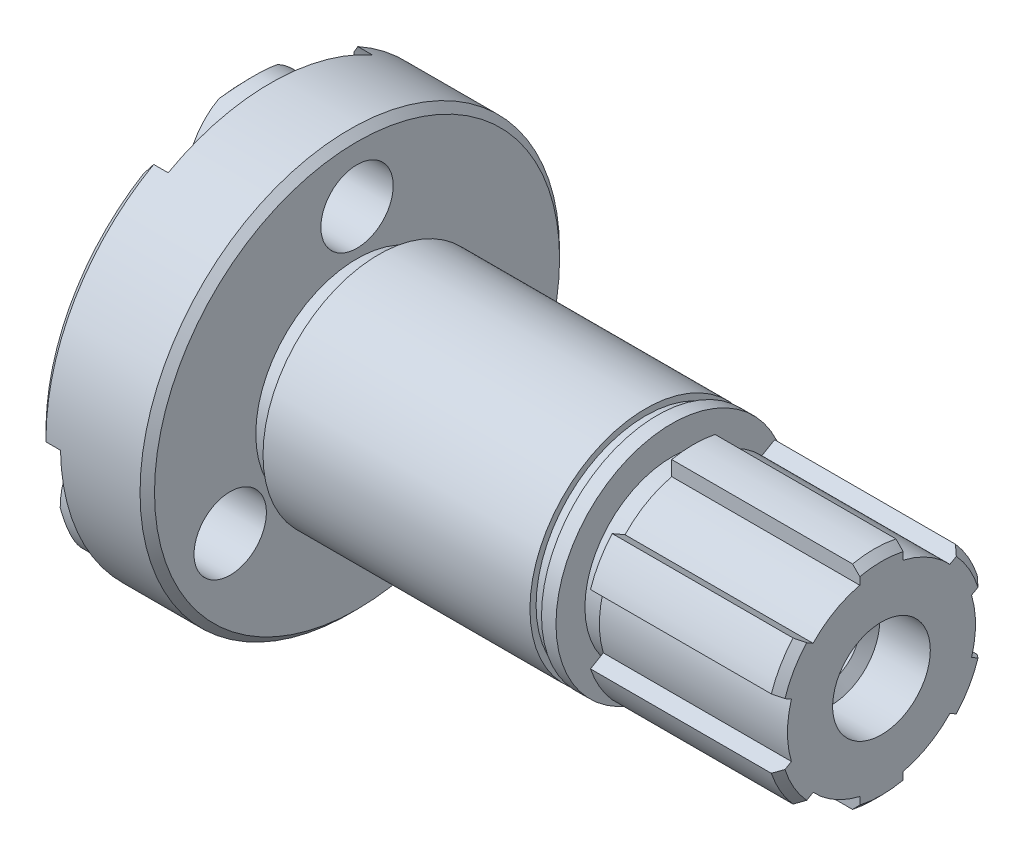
ISO-10303-21;
HEADER;
FILE_DESCRIPTION(('STEP AP214'),'2;1');
FILE_NAME('part.step','',(''),(''),'','','');
FILE_SCHEMA(('AUTOMOTIVE_DESIGN { 1 0 10303 214 1 1 1 1 }'));
ENDSEC;
DATA;
#1=APPLICATION_CONTEXT('core data for automotive mechanical design processes');
#2=APPLICATION_PROTOCOL_DEFINITION('international standard','automotive_design',2000,#1);
#3=PRODUCT_CONTEXT('',#1,'mechanical');
#4=PRODUCT('Part','Part','',(#3));
#5=PRODUCT_RELATED_PRODUCT_CATEGORY('part','',(#4));
#6=PRODUCT_DEFINITION_FORMATION('','',#4);
#7=PRODUCT_DEFINITION_CONTEXT('part definition',#1,'design');
#8=PRODUCT_DEFINITION('design','',#6,#7);
#9=PRODUCT_DEFINITION_SHAPE('','',#8);
#10=(LENGTH_UNIT() NAMED_UNIT(*) SI_UNIT(.MILLI.,.METRE.));
#11=(NAMED_UNIT(*) PLANE_ANGLE_UNIT() SI_UNIT($,.RADIAN.));
#12=(NAMED_UNIT(*) SI_UNIT($,.STERADIAN.) SOLID_ANGLE_UNIT());
#13=UNCERTAINTY_MEASURE_WITH_UNIT(LENGTH_MEASURE(1.E-05),#10,'distance_accuracy_value','');
#14=(GEOMETRIC_REPRESENTATION_CONTEXT(3) GLOBAL_UNCERTAINTY_ASSIGNED_CONTEXT((#13)) GLOBAL_UNIT_ASSIGNED_CONTEXT((#10,
#11,#12)) REPRESENTATION_CONTEXT('',''));
#15=CARTESIAN_POINT('',(0.,0.,0.));
#16=DIRECTION('',(0.,0.,1.));
#17=DIRECTION('',(1.,0.,0.));
#18=AXIS2_PLACEMENT_3D('',#15,#16,#17);
#19=CARTESIAN_POINT('',(0.,0.,0.));
#20=DIRECTION('',(-1.,0.,0.));
#21=DIRECTION('',(0.,0.,1.));
#22=AXIS2_PLACEMENT_3D('',#19,#20,#21);
#23=CYLINDRICAL_SURFACE('',#22,15.);
#24=CARTESIAN_POINT('',(61.5,0.,0.));
#25=DIRECTION('',(-1.,0.,0.));
#26=DIRECTION('',(0.,0.,1.));
#27=AXIS2_PLACEMENT_3D('',#24,#25,#26);
#28=CIRCLE('',#27,15.);
#29=CARTESIAN_POINT('',(61.5,-4.75039301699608,-14.2279220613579));
#30=VERTEX_POINT('',#29);
#31=CARTESIAN_POINT('',(61.5,-9.94654543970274,-11.2279220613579));
#32=VERTEX_POINT('',#31);
#33=EDGE_CURVE('E454',#30,#32,#28,.T.);
#34=ORIENTED_EDGE('',*,*,#33,.F.);
#35=DIRECTION('',(1.,0.,0.));
#36=VECTOR('',#35,1.);
#37=CARTESIAN_POINT('',(-0.001000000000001,-4.75039301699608,-14.2279220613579));
#38=LINE('',#37,#36);
#39=CARTESIAN_POINT('',(86.5,-4.75039301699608,-14.2279220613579));
#40=VERTEX_POINT('',#39);
#41=EDGE_CURVE('E341',#30,#40,#38,.T.);
#42=ORIENTED_EDGE('',*,*,#41,.T.);
#43=CARTESIAN_POINT('',(86.5,0.,0.));
#44=DIRECTION('',(-1.,0.,0.));
#45=DIRECTION('',(0.,0.,1.));
#46=AXIS2_PLACEMENT_3D('',#43,#44,#45);
#47=CIRCLE('',#46,15.);
#48=CARTESIAN_POINT('',(86.5,-9.94654543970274,-11.2279220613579));
#49=VERTEX_POINT('',#48);
#50=EDGE_CURVE('E64',#40,#49,#47,.T.);
#51=ORIENTED_EDGE('',*,*,#50,.T.);
#52=DIRECTION('',(1.,0.,0.));
#53=VECTOR('',#52,1.);
#54=CARTESIAN_POINT('',(-0.001000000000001,-9.94654543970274,-11.2279220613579));
#55=LINE('',#54,#53);
#56=EDGE_CURVE('E929',#32,#49,#55,.T.);
#57=ORIENTED_EDGE('',*,*,#56,.F.);
#58=EDGE_LOOP('',(#34,#42,#51,#57));
#59=FACE_BOUND('',#58,.T.);
#60=ADVANCED_FACE('F40',(#59),#23,.T.);
#61=CARTESIAN_POINT('',(86.5,0.,0.));
#62=DIRECTION('',(-1.,0.,0.));
#63=DIRECTION('',(0.,0.,1.));
#64=AXIS2_PLACEMENT_3D('',#61,#62,#63);
#65=CONICAL_SURFACE('',#64,15.,0.785398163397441);
#66=CARTESIAN_POINT('',(86.4998,-4.75049507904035,-14.2280988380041));
#67=CARTESIAN_POINT('',(86.6666649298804,-4.6653467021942,-14.0806175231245));
#68=CARTESIAN_POINT('',(86.833464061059,-4.58016613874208,-13.9330804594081));
#69=CARTESIAN_POINT('',(87.166930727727,-4.40974063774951,-13.6378948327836));
#70=CARTESIAN_POINT('',(87.3335982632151,-4.3244957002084,-13.4902462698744));
#71=CARTESIAN_POINT('',(87.5002,-4.23921857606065,-13.3425419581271));
#72=B_SPLINE_CURVE_WITH_KNOTS('',3,(#66,#67,#68,#69,#70,#71),.UNSPECIFIED.,.F.,.F.,(4,2,4),(0.,
0.715264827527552,1.43052966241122),.UNSPECIFIED.);
#73=CARTESIAN_POINT('',(87.5,-4.23932095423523,-13.342719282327));
#74=VERTEX_POINT('',#73);
#75=EDGE_CURVE('E356',#40,#74,#72,.T.);
#76=ORIENTED_EDGE('',*,*,#75,.T.);
#77=CARTESIAN_POINT('',(87.5,0.,0.));
#78=DIRECTION('',(-1.,0.,0.));
#79=DIRECTION('',(0.,0.,1.));
#80=AXIS2_PLACEMENT_3D('',#77,#78,#79);
#81=CIRCLE('',#80,14.);
#82=CARTESIAN_POINT('',(87.5,-9.43547337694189,-10.3427192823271));
#83=VERTEX_POINT('',#82);
#84=EDGE_CURVE('E1191',#83,#74,#81,.F.);
#85=ORIENTED_EDGE('',*,*,#84,.F.);
#86=CARTESIAN_POINT('',(87.5002,-9.43537099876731,-10.3425419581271));
#87=CARTESIAN_POINT('',(87.3335982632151,-9.52064812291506,-10.4902462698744));
#88=CARTESIAN_POINT('',(87.166930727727,-9.60589306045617,-10.6378948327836));
#89=CARTESIAN_POINT('',(86.833464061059,-9.77631856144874,-10.9330804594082));
#90=CARTESIAN_POINT('',(86.6666649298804,-9.86149912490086,-11.0806175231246));
#91=CARTESIAN_POINT('',(86.4998,-9.94664750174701,-11.2280988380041));
#92=B_SPLINE_CURVE_WITH_KNOTS('',3,(#86,#87,#88,#89,#90,#91),.UNSPECIFIED.,.F.,.F.,(4,2,4),(0.,
0.715264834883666,1.43052966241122),.UNSPECIFIED.);
#93=EDGE_CURVE('E894',#83,#49,#92,.T.);
#94=ORIENTED_EDGE('',*,*,#93,.T.);
#95=ORIENTED_EDGE('',*,*,#50,.F.);
#96=EDGE_LOOP('',(#76,#85,#94,#95));
#97=FACE_BOUND('',#96,.T.);
#98=ADVANCED_FACE('F381',(#97),#65,.T.);
#99=CARTESIAN_POINT('',(61.5,-14.696938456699,-3.00000000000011));
#100=VERTEX_POINT('',#99);
#101=CARTESIAN_POINT('',(61.5,-14.6969384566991,2.99999999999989));
#102=VERTEX_POINT('',#101);
#103=EDGE_CURVE('E451',#100,#102,#28,.T.);
#104=ORIENTED_EDGE('',*,*,#103,.F.);
#105=DIRECTION('',(1.,0.,0.));
#106=VECTOR('',#105,1.);
#107=CARTESIAN_POINT('',(-0.001000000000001,-14.696938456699,-3.00000000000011));
#108=LINE('',#107,#106);
#109=CARTESIAN_POINT('',(86.5,-14.696938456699,-3.00000000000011));
#110=VERTEX_POINT('',#109);
#111=EDGE_CURVE('E887',#100,#110,#108,.T.);
#112=ORIENTED_EDGE('',*,*,#111,.T.);
#113=CARTESIAN_POINT('',(86.5,-14.6969384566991,2.99999999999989));
#114=VERTEX_POINT('',#113);
#115=EDGE_CURVE('E994',#110,#114,#47,.T.);
#116=ORIENTED_EDGE('',*,*,#115,.T.);
#117=DIRECTION('',(1.,0.,0.));
#118=VECTOR('',#117,1.);
#119=CARTESIAN_POINT('',(-0.001000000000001,-14.6969384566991,2.99999999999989));
#120=LINE('',#119,#118);
#121=EDGE_CURVE('E992',#102,#114,#120,.T.);
#122=ORIENTED_EDGE('',*,*,#121,.F.);
#123=EDGE_LOOP('',(#104,#112,#116,#122));
#124=FACE_BOUND('',#123,.T.);
#125=ADVANCED_FACE('F383',(#124),#23,.T.);
#126=CARTESIAN_POINT('',(83.5729349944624,-17.6742654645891,-3.00000000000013));
#127=CARTESIAN_POINT('',(84.1033294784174,-17.1362474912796,-3.00000000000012));
#128=CARTESIAN_POINT('',(84.6334157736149,-16.5979248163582,-3.00000000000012));
#129=CARTESIAN_POINT('',(85.6926619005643,-15.5203752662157,-3.00000000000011));
#130=CARTESIAN_POINT('',(86.2218217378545,-14.9811483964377,-3.00000000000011));
#131=CARTESIAN_POINT('',(87.2789131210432,-13.9014872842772,-3.0000000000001));
#132=CARTESIAN_POINT('',(87.8068446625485,-13.3610530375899,-3.0000000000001));
#133=CARTESIAN_POINT('',(88.5974234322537,-12.5491144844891,-3.00000000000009));
#134=CARTESIAN_POINT('',(88.860730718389,-12.2782529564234,-3.00000000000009));
#135=CARTESIAN_POINT('',(89.3868039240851,-11.7360040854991,-3.00000000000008));
#136=CARTESIAN_POINT('',(89.6495698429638,-11.4646167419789,-3.00000000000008));
#137=CARTESIAN_POINT('',(89.9120140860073,-11.1929181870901,-3.00000000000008));
#138=B_SPLINE_CURVE_WITH_KNOTS('',3,(#126,#127,#128,#129,#130,#131,#132,#133,#134,#135,#136,
#137),.UNSPECIFIED.,.F.,.F.,(4,2,2,2,2,4),(0.,2.2665035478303,4.53299350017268,6.79949154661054,
7.93274735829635,9.0660045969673),.UNSPECIFIED.);
#139=CARTESIAN_POINT('',(87.5,-13.6747943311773,-3.0000000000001));
#140=VERTEX_POINT('',#139);
#141=EDGE_CURVE('E904',#110,#140,#138,.T.);
#142=ORIENTED_EDGE('',*,*,#141,.T.);
#143=CARTESIAN_POINT('',(87.5,-13.6747943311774,2.9999999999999));
#144=VERTEX_POINT('',#143);
#145=EDGE_CURVE('E1617',#144,#140,#81,.F.);
#146=ORIENTED_EDGE('',*,*,#145,.F.);
#147=CARTESIAN_POINT('',(89.9120140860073,-11.1929181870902,2.99999999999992));
#148=CARTESIAN_POINT('',(89.6495698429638,-11.464616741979,2.99999999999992));
#149=CARTESIAN_POINT('',(89.3868039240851,-11.7360040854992,2.99999999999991));
#150=CARTESIAN_POINT('',(88.860730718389,-12.2782529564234,2.99999999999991));
#151=CARTESIAN_POINT('',(88.5974234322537,-12.5491144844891,2.99999999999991));
#152=CARTESIAN_POINT('',(87.8068446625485,-13.3610530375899,2.9999999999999));
#153=CARTESIAN_POINT('',(87.2789131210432,-13.9014872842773,2.9999999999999));
#154=CARTESIAN_POINT('',(86.2218217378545,-14.9811483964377,2.99999999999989));
#155=CARTESIAN_POINT('',(85.6926619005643,-15.5203752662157,2.99999999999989));
#156=CARTESIAN_POINT('',(84.6334157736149,-16.5979248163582,2.99999999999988));
#157=CARTESIAN_POINT('',(84.1033294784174,-17.1362474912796,2.99999999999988));
#158=CARTESIAN_POINT('',(83.5729349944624,-17.6742654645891,2.99999999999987));
#159=B_SPLINE_CURVE_WITH_KNOTS('',3,(#147,#148,#149,#150,#151,#152,#153,#154,#155,#156,#157,
#158),.UNSPECIFIED.,.F.,.F.,(4,2,2,2,2,4),(0.,1.13325723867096,2.26651305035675,
4.53301109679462,6.79950104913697,9.06600459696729),.UNSPECIFIED.);
#160=EDGE_CURVE('E954',#144,#114,#159,.T.);
#161=ORIENTED_EDGE('',*,*,#160,.T.);
#162=ORIENTED_EDGE('',*,*,#115,.F.);
#163=EDGE_LOOP('',(#142,#146,#161,#162));
#164=FACE_BOUND('',#163,.T.);
#165=ADVANCED_FACE('F390',(#164),#65,.T.);
#166=CARTESIAN_POINT('',(61.5,-9.94654543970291,11.2279220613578));
#167=VERTEX_POINT('',#166);
#168=CARTESIAN_POINT('',(61.5,-4.75039301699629,14.2279220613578));
#169=VERTEX_POINT('',#168);
#170=EDGE_CURVE('E442',#167,#169,#28,.T.);
#171=ORIENTED_EDGE('',*,*,#170,.F.);
#172=DIRECTION('',(1.,0.,0.));
#173=VECTOR('',#172,1.);
#174=CARTESIAN_POINT('',(-0.001000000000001,-9.94654543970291,11.2279220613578));
#175=LINE('',#174,#173);
#176=CARTESIAN_POINT('',(86.5,-9.9465454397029,11.2279220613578));
#177=VERTEX_POINT('',#176);
#178=EDGE_CURVE('E443',#167,#177,#175,.T.);
#179=ORIENTED_EDGE('',*,*,#178,.T.);
#180=CARTESIAN_POINT('',(86.5,-4.75039301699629,14.2279220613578));
#181=VERTEX_POINT('',#180);
#182=EDGE_CURVE('E1192',#177,#181,#47,.T.);
#183=ORIENTED_EDGE('',*,*,#182,.T.);
#184=DIRECTION('',(1.,0.,0.));
#185=VECTOR('',#184,1.);
#186=CARTESIAN_POINT('',(-0.001000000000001,-4.75039301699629,14.2279220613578));
#187=LINE('',#186,#185);
#188=EDGE_CURVE('E446',#169,#181,#187,.T.);
#189=ORIENTED_EDGE('',*,*,#188,.F.);
#190=EDGE_LOOP('',(#171,#179,#183,#189));
#191=FACE_BOUND('',#190,.T.);
#192=ADVANCED_FACE('F397',(#191),#23,.T.);
#193=CARTESIAN_POINT('',(86.4998,-9.94664750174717,11.228098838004));
#194=CARTESIAN_POINT('',(86.6666649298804,-9.86149912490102,11.0806175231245));
#195=CARTESIAN_POINT('',(86.8334640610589,-9.7763185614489,10.933080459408));
#196=CARTESIAN_POINT('',(87.166930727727,-9.60589306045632,10.6378948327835));
#197=CARTESIAN_POINT('',(87.3335982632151,-9.52064812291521,10.4902462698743));
#198=CARTESIAN_POINT('',(87.5002,-9.43537099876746,10.342541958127));
#199=B_SPLINE_CURVE_WITH_KNOTS('',3,(#193,#194,#195,#196,#197,#198),.UNSPECIFIED.,.F.,.F.,(4,2,
4),(0.,0.715264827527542,1.43052966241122),.UNSPECIFIED.);
#200=CARTESIAN_POINT('',(87.5,-9.43547337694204,10.342719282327));
#201=VERTEX_POINT('',#200);
#202=EDGE_CURVE('E964',#177,#201,#199,.T.);
#203=ORIENTED_EDGE('',*,*,#202,.T.);
#204=CARTESIAN_POINT('',(87.5,-4.23932095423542,13.342719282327));
#205=VERTEX_POINT('',#204);
#206=EDGE_CURVE('E1195',#205,#201,#81,.F.);
#207=ORIENTED_EDGE('',*,*,#206,.F.);
#208=CARTESIAN_POINT('',(87.5002,-4.23921857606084,13.342541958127));
#209=CARTESIAN_POINT('',(87.3335982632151,-4.32449570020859,13.4902462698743));
#210=CARTESIAN_POINT('',(87.166930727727,-4.4097406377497,13.6378948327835));
#211=CARTESIAN_POINT('',(86.833464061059,-4.58016613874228,13.9330804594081));
#212=CARTESIAN_POINT('',(86.6666649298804,-4.66534670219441,14.0806175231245));
#213=CARTESIAN_POINT('',(86.4998,-4.75049507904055,14.228098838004));
#214=B_SPLINE_CURVE_WITH_KNOTS('',3,(#208,#209,#210,#211,#212,#213),.UNSPECIFIED.,.F.,.F.,(4,2,
4),(0.,0.715264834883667,1.43052966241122),.UNSPECIFIED.);
#215=EDGE_CURVE('E1018',#205,#181,#214,.T.);
#216=ORIENTED_EDGE('',*,*,#215,.T.);
#217=ORIENTED_EDGE('',*,*,#182,.F.);
#218=EDGE_LOOP('',(#203,#207,#216,#217));
#219=FACE_BOUND('',#218,.T.);
#220=ADVANCED_FACE('F424',(#219),#65,.T.);
#221=CARTESIAN_POINT('',(61.5,4.75039301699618,14.2279220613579));
#222=VERTEX_POINT('',#221);
#223=CARTESIAN_POINT('',(61.5,9.94654543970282,11.2279220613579));
#224=VERTEX_POINT('',#223);
#225=EDGE_CURVE('E452',#222,#224,#28,.T.);
#226=ORIENTED_EDGE('',*,*,#225,.F.);
#227=DIRECTION('',(1.,0.,0.));
#228=VECTOR('',#227,1.);
#229=CARTESIAN_POINT('',(-0.001000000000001,4.75039301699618,14.2279220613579));
#230=LINE('',#229,#228);
#231=CARTESIAN_POINT('',(86.5,4.75039301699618,14.2279220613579));
#232=VERTEX_POINT('',#231);
#233=EDGE_CURVE('E1012',#222,#232,#230,.T.);
#234=ORIENTED_EDGE('',*,*,#233,.T.);
#235=CARTESIAN_POINT('',(86.5,9.94654543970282,11.2279220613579));
#236=VERTEX_POINT('',#235);
#237=EDGE_CURVE('E1119',#232,#236,#47,.T.);
#238=ORIENTED_EDGE('',*,*,#237,.T.);
#239=DIRECTION('',(1.,0.,0.));
#240=VECTOR('',#239,1.);
#241=CARTESIAN_POINT('',(-0.001000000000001,9.94654543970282,11.2279220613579));
#242=LINE('',#241,#240);
#243=EDGE_CURVE('E1117',#224,#236,#242,.T.);
#244=ORIENTED_EDGE('',*,*,#243,.F.);
#245=EDGE_LOOP('',(#226,#234,#238,#244));
#246=FACE_BOUND('',#245,.T.);
#247=ADVANCED_FACE('F416',(#246),#23,.T.);
#248=CARTESIAN_POINT('',(86.4998,4.75049507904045,14.2280988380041));
#249=CARTESIAN_POINT('',(86.6666649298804,4.6653467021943,14.0806175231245));
#250=CARTESIAN_POINT('',(86.833464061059,4.58016613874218,13.9330804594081));
#251=CARTESIAN_POINT('',(87.166930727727,4.40974063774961,13.6378948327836));
#252=CARTESIAN_POINT('',(87.3335982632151,4.3244957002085,13.4902462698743));
#253=CARTESIAN_POINT('',(87.5002,4.23921857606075,13.3425419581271));
#254=B_SPLINE_CURVE_WITH_KNOTS('',3,(#248,#249,#250,#251,#252,#253),.UNSPECIFIED.,.F.,.F.,(4,2,
4),(0.,0.715264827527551,1.43052966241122),.UNSPECIFIED.);
#255=CARTESIAN_POINT('',(87.5,4.23932095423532,13.342719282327));
#256=VERTEX_POINT('',#255);
#257=EDGE_CURVE('E1028',#232,#256,#254,.T.);
#258=ORIENTED_EDGE('',*,*,#257,.T.);
#259=CARTESIAN_POINT('',(87.5,9.43547337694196,10.342719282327));
#260=VERTEX_POINT('',#259);
#261=EDGE_CURVE('E518',#260,#256,#81,.F.);
#262=ORIENTED_EDGE('',*,*,#261,.F.);
#263=CARTESIAN_POINT('',(87.5002,9.43537099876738,10.3425419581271));
#264=CARTESIAN_POINT('',(87.3335982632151,9.52064812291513,10.4902462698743));
#265=CARTESIAN_POINT('',(87.166930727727,9.60589306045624,10.6378948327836));
#266=CARTESIAN_POINT('',(86.833464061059,9.77631856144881,10.9330804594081));
#267=CARTESIAN_POINT('',(86.6666649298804,9.86149912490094,11.0806175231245));
#268=CARTESIAN_POINT('',(86.4998,9.94664750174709,11.2280988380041));
#269=B_SPLINE_CURVE_WITH_KNOTS('',3,(#263,#264,#265,#266,#267,#268),.UNSPECIFIED.,.F.,.F.,(4,2,
4),(0.,0.715264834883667,1.43052966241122),.UNSPECIFIED.);
#270=EDGE_CURVE('E1079',#260,#236,#269,.T.);
#271=ORIENTED_EDGE('',*,*,#270,.T.);
#272=ORIENTED_EDGE('',*,*,#237,.F.);
#273=EDGE_LOOP('',(#258,#262,#271,#272));
#274=FACE_BOUND('',#273,.T.);
#275=ADVANCED_FACE('F414',(#274),#65,.T.);
#276=CARTESIAN_POINT('',(61.5,14.6969384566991,3.));
#277=VERTEX_POINT('',#276);
#278=CARTESIAN_POINT('',(61.5,14.6969384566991,-3.));
#279=VERTEX_POINT('',#278);
#280=EDGE_CURVE('E455',#277,#279,#28,.T.);
#281=ORIENTED_EDGE('',*,*,#280,.F.);
#282=DIRECTION('',(1.,0.,0.));
#283=VECTOR('',#282,1.);
#284=CARTESIAN_POINT('',(-0.001000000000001,14.6969384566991,3.));
#285=LINE('',#284,#283);
#286=CARTESIAN_POINT('',(86.5,14.6969384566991,3.));
#287=VERTEX_POINT('',#286);
#288=EDGE_CURVE('E1072',#277,#287,#285,.T.);
#289=ORIENTED_EDGE('',*,*,#288,.T.);
#290=CARTESIAN_POINT('',(86.5,14.6969384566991,-3.));
#291=VERTEX_POINT('',#290);
#292=EDGE_CURVE('E510',#287,#291,#47,.T.);
#293=ORIENTED_EDGE('',*,*,#292,.T.);
#294=DIRECTION('',(1.,0.,0.));
#295=VECTOR('',#294,1.);
#296=CARTESIAN_POINT('',(-0.001000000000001,14.6969384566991,-3.));
#297=LINE('',#296,#295);
#298=EDGE_CURVE('E1175',#279,#291,#297,.T.);
#299=ORIENTED_EDGE('',*,*,#298,.F.);
#300=EDGE_LOOP('',(#281,#289,#293,#299));
#301=FACE_BOUND('',#300,.T.);
#302=ADVANCED_FACE('F402',(#301),#23,.T.);
#303=CARTESIAN_POINT('',(84.0752357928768,17.1645683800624,3.00000000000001));
#304=CARTESIAN_POINT('',(84.6054008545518,16.6263231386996,3.));
#305=CARTESIAN_POINT('',(85.1352325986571,16.0877484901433,3.));
#306=CARTESIAN_POINT('',(86.1938754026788,15.0096050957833,3.));
#307=CARTESIAN_POINT('',(86.7226864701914,14.4700363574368,3.));
#308=CARTESIAN_POINT('',(87.778944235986,13.389558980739,3.));
#309=CARTESIAN_POINT('',(88.3063909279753,12.8486503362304,3.));
#310=CARTESIAN_POINT('',(89.0960755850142,12.0358400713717,3.));
#311=CARTESIAN_POINT('',(89.3590572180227,11.7646610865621,3.));
#312=CARTESIAN_POINT('',(89.8844047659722,11.2217065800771,3.));
#313=CARTESIAN_POINT('',(90.1467706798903,10.9499310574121,3.));
#314=CARTESIAN_POINT('',(90.4087683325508,10.6778003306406,3.));
#315=B_SPLINE_CURVE_WITH_KNOTS('',3,(#303,#304,#305,#306,#307,#308,#309,#310,#311,#312,#313,
#314),.UNSPECIFIED.,.F.,.F.,(4,2,2,2,2,4),(0.,2.26650629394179,4.53299565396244,
6.79949544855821,7.93275379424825,9.06601402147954),.UNSPECIFIED.);
#316=CARTESIAN_POINT('',(87.5,13.6747943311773,3.));
#317=VERTEX_POINT('',#316);
#318=EDGE_CURVE('E1089',#287,#317,#315,.T.);
#319=ORIENTED_EDGE('',*,*,#318,.T.);
#320=CARTESIAN_POINT('',(87.5,13.6747943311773,-3.));
#321=VERTEX_POINT('',#320);
#322=EDGE_CURVE('E514',#321,#317,#81,.F.);
#323=ORIENTED_EDGE('',*,*,#322,.F.);
#324=CARTESIAN_POINT('',(90.4087683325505,10.677800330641,-3.));
#325=CARTESIAN_POINT('',(90.1467706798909,10.9499310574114,-3.));
#326=CARTESIAN_POINT('',(89.8844047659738,11.2217065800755,-3.));
#327=CARTESIAN_POINT('',(89.3590572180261,11.7646610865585,-3.));
#328=CARTESIAN_POINT('',(89.0960755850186,12.0358400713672,-3.));
#329=CARTESIAN_POINT('',(88.3063909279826,12.8486503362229,-3.));
#330=CARTESIAN_POINT('',(87.7789442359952,13.3895589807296,-3.));
#331=CARTESIAN_POINT('',(86.7226864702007,14.4700363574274,-3.));
#332=CARTESIAN_POINT('',(86.1938754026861,15.0096050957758,-3.));
#333=CARTESIAN_POINT('',(85.1352325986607,16.0877484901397,-3.));
#334=CARTESIAN_POINT('',(84.6054008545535,16.6263231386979,-3.));
#335=CARTESIAN_POINT('',(84.0752357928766,17.1645683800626,-3.));
#336=B_SPLINE_CURVE_WITH_KNOTS('',3,(#324,#325,#326,#327,#328,#329,#330,#331,#332,#333,#334,
#335),.UNSPECIFIED.,.F.,.F.,(4,2,2,2,2,4),(0.,1.13326022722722,2.26651857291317,
4.53301836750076,6.79950772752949,9.06601402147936),.UNSPECIFIED.);
#337=EDGE_CURVE('E1140',#321,#291,#336,.T.);
#338=ORIENTED_EDGE('',*,*,#337,.T.);
#339=ORIENTED_EDGE('',*,*,#292,.F.);
#340=EDGE_LOOP('',(#319,#323,#338,#339));
#341=FACE_BOUND('',#340,.T.);
#342=ADVANCED_FACE('F413',(#341),#65,.T.);
#343=CARTESIAN_POINT('',(0.,29.,0.));
#344=DIRECTION('',(1.,0.,0.));
#345=DIRECTION('',(0.,0.,-1.));
#346=AXIS2_PLACEMENT_3D('',#343,#344,#345);
#347=PLANE('',#346);
#348=CARTESIAN_POINT('',(0.,-10.1249999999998,-17.537014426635));
#349=DIRECTION('',(-1.,0.,0.));
#350=DIRECTION('',(0.,0.866025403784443,-0.499999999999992));
#351=AXIS2_PLACEMENT_3D('',#348,#349,#350);
#352=CIRCLE('',#351,5.);
#353=CARTESIAN_POINT('',(0.,-5.79487298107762,-20.0370144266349));
#354=VERTEX_POINT('',#353);
#355=EDGE_CURVE('E674',#354,#354,#352,.T.);
#356=ORIENTED_EDGE('',*,*,#355,.F.);
#357=EDGE_LOOP('',(#356));
#358=FACE_BOUND('',#357,.T.);
#359=CARTESIAN_POINT('',(0.,-10.1249999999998,-17.537014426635));
#360=DIRECTION('',(-1.,0.,0.));
#361=DIRECTION('',(0.,0.866025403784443,-0.499999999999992));
#362=AXIS2_PLACEMENT_3D('',#359,#360,#361);
#363=CIRCLE('',#362,8.5);
#364=CARTESIAN_POINT('',(0.,-17.3950936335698,-21.9410737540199));
#365=VERTEX_POINT('',#364);
#366=CARTESIAN_POINT('',(0.,-10.3039804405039,-26.0351298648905));
#367=VERTEX_POINT('',#366);
#368=EDGE_CURVE('E733',#365,#367,#363,.T.);
#369=ORIENTED_EDGE('',*,*,#368,.T.);
#370=CARTESIAN_POINT('',(0.,0.,0.));
#371=DIRECTION('',(1.,0.,0.));
#372=DIRECTION('',(0.,0.,-1.));
#373=AXIS2_PLACEMENT_3D('',#370,#371,#372);
#374=CIRCLE('',#373,28.);
#375=EDGE_CURVE('E497',#367,#365,#374,.F.);
#376=ORIENTED_EDGE('',*,*,#375,.T.);
#377=EDGE_LOOP('',(#369,#376));
#378=FACE_BOUND('',#377,.T.);
#379=ADVANCED_FACE('F421',(#358,#378),#347,.F.);
#380=CARTESIAN_POINT('',(0.,0.,0.));
#381=DIRECTION('',(1.,0.,0.));
#382=DIRECTION('',(0.,0.,-1.));
#383=AXIS2_PLACEMENT_3D('',#380,#381,#382);
#384=CONICAL_SURFACE('',#383,28.,0.785398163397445);
#385=CARTESIAN_POINT('',(-0.000199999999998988,0.630397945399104,-27.9927025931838));
#386=CARTESIAN_POINT('',(0.0850057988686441,0.545691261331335,-28.079837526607));
#387=CARTESIAN_POINT('',(0.169775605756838,0.459711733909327,-28.1661628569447));
#388=CARTESIAN_POINT('',(0.338375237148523,0.285261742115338,-28.337077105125));
#389=CARTESIAN_POINT('',(0.422205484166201,0.196792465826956,-28.4216668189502));
#390=CARTESIAN_POINT('',(0.588938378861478,0.017337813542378,-28.589074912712));
#391=CARTESIAN_POINT('',(0.671841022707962,-0.0736475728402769,-28.671893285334));
#392=CARTESIAN_POINT('',(0.836727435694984,-0.258160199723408,-28.8357179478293));
#393=CARTESIAN_POINT('',(0.918710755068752,-0.351688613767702,-28.9167233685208));
#394=CARTESIAN_POINT('',(1.00019999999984,-0.446458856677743,-28.9967631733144));
#395=B_SPLINE_CURVE_WITH_KNOTS('',3,(#385,#386,#387,#388,#389,#390,#391,#392,#393,#394),
.UNSPECIFIED.,.F.,.F.,(4,2,2,2,4),(0.,0.445245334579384,0.890281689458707,1.3353198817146,
1.78056705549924),.UNSPECIFIED.);
#396=CARTESIAN_POINT('',(0.,0.630199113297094,-27.992907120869));
#397=VERTEX_POINT('',#396);
#398=CARTESIAN_POINT('',(1.00000000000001,-0.446226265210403,-28.9965667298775));
#399=VERTEX_POINT('',#398);
#400=EDGE_CURVE('E49',#397,#399,#395,.T.);
#401=ORIENTED_EDGE('',*,*,#400,.F.);
#402=CARTESIAN_POINT('',(0.,23.9274691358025,-14.542222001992));
#403=VERTEX_POINT('',#402);
#404=EDGE_CURVE('E493',#403,#397,#374,.F.);
#405=ORIENTED_EDGE('',*,*,#404,.F.);
#406=CARTESIAN_POINT('',(1.00020000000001,25.3351629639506,-14.1117368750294));
#407=CARTESIAN_POINT('',(0.9187107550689,25.2184613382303,-14.1537904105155));
#408=CARTESIAN_POINT('',(0.836727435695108,25.101544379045,-14.1942856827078));
#409=CARTESIAN_POINT('',(0.67184102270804,24.8674117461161,-14.27216597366));
#410=CARTESIAN_POINT('',(0.588938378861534,24.750196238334,-14.3095524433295));
#411=CARTESIAN_POINT('',(0.422205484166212,24.5154892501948,-14.3812606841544));
#412=CARTESIAN_POINT('',(0.338375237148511,24.3979977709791,-14.4155824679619));
#413=CARTESIAN_POINT('',(0.169775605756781,24.1627566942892,-14.4812034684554));
#414=CARTESIAN_POINT('',(0.0850057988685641,24.0450070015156,-14.5125012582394));
#415=CARTESIAN_POINT('',(-0.000200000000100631,23.9271925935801,-14.5422919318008));
#416=B_SPLINE_CURVE_WITH_KNOTS('',3,(#406,#407,#408,#409,#410,#411,#412,#413,#414,#415),
.UNSPECIFIED.,.F.,.F.,(4,2,2,2,4),(0.,0.445247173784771,0.890285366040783,1.33532172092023,
1.78056705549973),.UNSPECIFIED.);
#417=CARTESIAN_POINT('',(1.00000000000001,25.3348765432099,-14.1118400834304));
#418=VERTEX_POINT('',#417);
#419=EDGE_CURVE('E554',#418,#403,#416,.T.);
#420=ORIENTED_EDGE('',*,*,#419,.F.);
#421=CARTESIAN_POINT('',(1.00000000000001,0.,0.));
#422=DIRECTION('',(1.,0.,0.));
#423=DIRECTION('',(0.,0.,-1.));
#424=AXIS2_PLACEMENT_3D('',#421,#422,#423);
#425=CIRCLE('',#424,29.);
#426=EDGE_CURVE('E502',#399,#418,#425,.T.);
#427=ORIENTED_EDGE('',*,*,#426,.F.);
#428=EDGE_LOOP('',(#401,#405,#420,#427));
#429=FACE_BOUND('',#428,.T.);
#430=ADVANCED_FACE('F752',(#429),#384,.T.);
#431=ORIENTED_EDGE('',*,*,#375,.F.);
#432=CARTESIAN_POINT('',(-0.942327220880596,-8.14402978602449,-25.8029539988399));
#433=CARTESIAN_POINT('',(-0.851942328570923,-8.31470674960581,-25.8438656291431));
#434=CARTESIAN_POINT('',(-0.764241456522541,-8.48803725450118,-25.8798066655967));
#435=CARTESIAN_POINT('',(-0.594649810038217,-8.83944011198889,-25.9411282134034));
#436=CARTESIAN_POINT('',(-0.512761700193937,-9.01751458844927,-25.9665039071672));
#437=CARTESIAN_POINT('',(-0.355006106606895,-9.37840351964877,-26.0061160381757));
#438=CARTESIAN_POINT('',(-0.279164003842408,-9.56123407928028,-26.0203075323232));
#439=CARTESIAN_POINT('',(-0.134381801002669,-9.93012251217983,-26.0367852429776));
#440=CARTESIAN_POINT('',(-0.0654409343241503,-10.1161800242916,-26.0390727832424));
#441=CARTESIAN_POINT('',(0.0673823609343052,-10.4973522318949,-26.0310700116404));
#442=CARTESIAN_POINT('',(0.130994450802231,-10.6925523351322,-26.0203253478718));
#443=CARTESIAN_POINT('',(0.249713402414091,-11.0842794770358,-25.9849995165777));
#444=CARTESIAN_POINT('',(0.304820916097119,-11.2808064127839,-25.9604194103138));
#445=CARTESIAN_POINT('',(0.40593698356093,-11.6736349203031,-25.8971131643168));
#446=CARTESIAN_POINT('',(0.451958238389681,-11.8699364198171,-25.8584069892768));
#447=CARTESIAN_POINT('',(0.534520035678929,-12.2611866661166,-25.7666606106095));
#448=CARTESIAN_POINT('',(0.571060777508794,-12.4561354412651,-25.7136207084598));
#449=CARTESIAN_POINT('',(0.634380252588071,-12.8439552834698,-25.592986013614));
#450=CARTESIAN_POINT('',(0.661120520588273,-13.036815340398,-25.5253354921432));
#451=CARTESIAN_POINT('',(0.704324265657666,-13.4181446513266,-25.3758368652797));
#452=CARTESIAN_POINT('',(0.720787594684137,-13.6066138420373,-25.2939885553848));
#453=CARTESIAN_POINT('',(0.743240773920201,-13.9777078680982,-25.1165237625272));
#454=CARTESIAN_POINT('',(0.749225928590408,-14.1603300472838,-25.0209011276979));
#455=CARTESIAN_POINT('',(0.750633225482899,-14.5181619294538,-24.8166138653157));
#456=CARTESIAN_POINT('',(0.746055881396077,-14.693371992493,-24.7079498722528));
#457=CARTESIAN_POINT('',(0.726827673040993,-15.027551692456,-24.4835038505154));
#458=CARTESIAN_POINT('',(0.712626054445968,-15.1868964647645,-24.3682408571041));
#459=CARTESIAN_POINT('',(0.674777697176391,-15.4965286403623,-24.1275479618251));
#460=CARTESIAN_POINT('',(0.651130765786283,-15.6468158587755,-24.0021178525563));
#461=CARTESIAN_POINT('',(0.594672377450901,-15.9373131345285,-23.742251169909));
#462=CARTESIAN_POINT('',(0.561868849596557,-16.0775317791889,-23.6078224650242));
#463=CARTESIAN_POINT('',(0.487439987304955,-16.3472904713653,-23.3310158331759));
#464=CARTESIAN_POINT('',(0.445816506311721,-16.4768327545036,-23.18863958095));
#465=CARTESIAN_POINT('',(0.344899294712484,-16.7497424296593,-22.8676465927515));
#466=CARTESIAN_POINT('',(0.283735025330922,-16.8906362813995,-22.687507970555));
#467=CARTESIAN_POINT('',(0.150065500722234,-17.155638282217,-22.3194362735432));
#468=CARTESIAN_POINT('',(0.0775644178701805,-17.2797525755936,-22.1315060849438));
#469=CARTESIAN_POINT('',(-0.087087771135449,-17.5245963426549,-21.7272601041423));
#470=CARTESIAN_POINT('',(-0.18054631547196,-17.6432203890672,-21.5102007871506));
#471=CARTESIAN_POINT('',(-0.379448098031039,-17.859401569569,-21.0709928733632));
#472=CARTESIAN_POINT('',(-0.484899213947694,-17.9569447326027,-20.8488410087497));
#473=CARTESIAN_POINT('',(-0.706877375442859,-18.1315286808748,-20.4011703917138));
#474=CARTESIAN_POINT('',(-0.823435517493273,-18.2085094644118,-20.1756437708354));
#475=CARTESIAN_POINT('',(-1.06625912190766,-18.3422680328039,-19.7238024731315));
#476=CARTESIAN_POINT('',(-1.19252668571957,-18.3990414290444,-19.4974876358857));
#477=CARTESIAN_POINT('',(-1.46701796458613,-18.4979938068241,-19.0228102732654));
#478=CARTESIAN_POINT('',(-1.616167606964,-18.5380940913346,-18.774552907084));
#479=CARTESIAN_POINT('',(-1.92268781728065,-18.5958216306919,-18.2827540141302));
#480=CARTESIAN_POINT('',(-2.07999857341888,-18.6135934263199,-18.0391923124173));
#481=CARTESIAN_POINT('',(-2.24123775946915,-18.6209891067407,-17.7981065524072));
#482=B_SPLINE_CURVE_WITH_KNOTS('',3,(#432,#433,#434,#435,#436,#437,#438,#439,#440,#441,#442,
#443,#444,#445,#446,#447,#448,#449,#450,#451,#452,#453,#454,#455,#456,#457,#458,#459,#460,#461,
#462,#463,#464,#465,#466,#467,#468,#469,#470,#471,#472,#473,#474,#475,#476,#477,#478,#479,#480,
#481),.UNSPECIFIED.,.F.,.F.,(4,2,2,2,2,2,2,2,2,2,2,2,2,2,2,2,2,2,2,2,2,2,2,2,4),(0.,
0.592207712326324,1.18468516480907,1.77953148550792,2.37431165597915,2.99043784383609,
3.60651677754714,4.22172834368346,4.83692697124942,5.45451493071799,6.0721117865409,
6.68998533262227,7.30782883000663,7.89865536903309,8.48949396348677,9.07982250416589,
9.67002711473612,10.3791516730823,11.088015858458,11.8800442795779,12.6725960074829,
13.4674357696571,14.2624480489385,15.1385332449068,16.0089174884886),.UNSPECIFIED.);
#483=EDGE_CURVE('E604',#367,#365,#482,.T.);
#484=ORIENTED_EDGE('',*,*,#483,.T.);
#485=EDGE_LOOP('',(#431,#484));
#486=FACE_BOUND('',#485,.T.);
#487=ADVANCED_FACE('F735',(#486),#384,.T.);
#488=CARTESIAN_POINT('',(0.,-10.1250000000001,17.5370144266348));
#489=DIRECTION('',(-1.,0.,0.));
#490=DIRECTION('',(0.,-0.866025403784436,-0.500000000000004));
#491=AXIS2_PLACEMENT_3D('',#488,#489,#490);
#492=CIRCLE('',#491,5.);
#493=CARTESIAN_POINT('',(0.,-14.4551270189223,15.0370144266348));
#494=VERTEX_POINT('',#493);
#495=EDGE_CURVE('E678',#494,#494,#492,.T.);
#496=ORIENTED_EDGE('',*,*,#495,.F.);
#497=EDGE_LOOP('',(#496));
#498=FACE_BOUND('',#497,.T.);
#499=CARTESIAN_POINT('',(0.,-10.1250000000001,17.5370144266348));
#500=DIRECTION('',(-1.,0.,0.));
#501=DIRECTION('',(0.,-0.866025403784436,-0.500000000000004));
#502=AXIS2_PLACEMENT_3D('',#499,#500,#501);
#503=CIRCLE('',#502,8.5);
#504=CARTESIAN_POINT('',(0.,-10.3039804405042,26.0351298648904));
#505=VERTEX_POINT('',#504);
#506=CARTESIAN_POINT('',(0.,-17.3950936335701,21.9410737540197));
#507=VERTEX_POINT('',#506);
#508=EDGE_CURVE('E654',#505,#507,#503,.T.);
#509=ORIENTED_EDGE('',*,*,#508,.T.);
#510=EDGE_CURVE('E721',#507,#505,#374,.F.);
#511=ORIENTED_EDGE('',*,*,#510,.T.);
#512=EDGE_LOOP('',(#509,#511));
#513=FACE_BOUND('',#512,.T.);
#514=ADVANCED_FACE('F716',(#498,#513),#347,.F.);
#515=CARTESIAN_POINT('',(1.00019999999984,-0.446458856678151,28.9967631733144));
#516=CARTESIAN_POINT('',(0.918710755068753,-0.351688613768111,28.9167233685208));
#517=CARTESIAN_POINT('',(0.836727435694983,-0.258160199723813,28.8357179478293));
#518=CARTESIAN_POINT('',(0.671841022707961,-0.0736475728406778,28.671893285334));
#519=CARTESIAN_POINT('',(0.588938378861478,0.0173378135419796,28.589074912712));
#520=CARTESIAN_POINT('',(0.422205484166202,0.196792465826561,28.4216668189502));
#521=CARTESIAN_POINT('',(0.338375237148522,0.285261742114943,28.337077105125));
#522=CARTESIAN_POINT('',(0.169775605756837,0.459711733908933,28.1661628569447));
#523=CARTESIAN_POINT('',(0.0850057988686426,0.545691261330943,28.079837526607));
#524=CARTESIAN_POINT('',(-0.000199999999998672,0.630397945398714,27.9927025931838));
#525=B_SPLINE_CURVE_WITH_KNOTS('',3,(#515,#516,#517,#518,#519,#520,#521,#522,#523,#524),
.UNSPECIFIED.,.F.,.F.,(4,2,2,2,4),(0.,0.445247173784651,0.890285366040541,1.33532172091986,
1.78056705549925),.UNSPECIFIED.);
#526=CARTESIAN_POINT('',(1.00000000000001,-0.446226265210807,28.9965667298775));
#527=VERTEX_POINT('',#526);
#528=CARTESIAN_POINT('',(0.,0.630199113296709,27.992907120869));
#529=VERTEX_POINT('',#528);
#530=EDGE_CURVE('E596',#527,#529,#525,.T.);
#531=ORIENTED_EDGE('',*,*,#530,.F.);
#532=CARTESIAN_POINT('',(1.00000000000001,25.3348765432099,14.1118400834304));
#533=VERTEX_POINT('',#532);
#534=EDGE_CURVE('E503',#533,#527,#425,.T.);
#535=ORIENTED_EDGE('',*,*,#534,.F.);
#536=CARTESIAN_POINT('',(-0.000200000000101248,23.9271925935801,14.5422919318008));
#537=CARTESIAN_POINT('',(0.0850057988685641,24.0450070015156,14.5125012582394));
#538=CARTESIAN_POINT('',(0.169775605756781,24.1627566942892,14.4812034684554));
#539=CARTESIAN_POINT('',(0.33837523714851,24.3979977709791,14.4155824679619));
#540=CARTESIAN_POINT('',(0.422205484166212,24.5154892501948,14.3812606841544));
#541=CARTESIAN_POINT('',(0.588938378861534,24.750196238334,14.3095524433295));
#542=CARTESIAN_POINT('',(0.67184102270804,24.8674117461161,14.27216597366));
#543=CARTESIAN_POINT('',(0.836727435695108,25.101544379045,14.1942856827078));
#544=CARTESIAN_POINT('',(0.918710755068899,25.2184613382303,14.1537904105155));
#545=CARTESIAN_POINT('',(1.00020000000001,25.3351629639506,14.1117368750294));
#546=B_SPLINE_CURVE_WITH_KNOTS('',3,(#536,#537,#538,#539,#540,#541,#542,#543,#544,#545),
.UNSPECIFIED.,.F.,.F.,(4,2,2,2,4),(0.,0.445245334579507,0.890281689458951,1.33531988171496,
1.78056705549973),.UNSPECIFIED.);
#547=CARTESIAN_POINT('',(0.,23.9274691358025,14.542222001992));
#548=VERTEX_POINT('',#547);
#549=EDGE_CURVE('E527',#548,#533,#546,.T.);
#550=ORIENTED_EDGE('',*,*,#549,.F.);
#551=EDGE_CURVE('E492',#529,#548,#374,.F.);
#552=ORIENTED_EDGE('',*,*,#551,.F.);
#553=EDGE_LOOP('',(#531,#535,#550,#552));
#554=FACE_BOUND('',#553,.T.);
#555=ADVANCED_FACE('F759',(#554),#384,.T.);
#556=ORIENTED_EDGE('',*,*,#510,.F.);
#557=CARTESIAN_POINT('',(-0.000199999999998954,-17.3953910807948,21.9405826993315));
#558=CARTESIAN_POINT('',(0.0672496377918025,-17.2951297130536,22.1061621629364));
#559=CARTESIAN_POINT('',(0.130735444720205,-17.1884330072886,22.269512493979));
#560=CARTESIAN_POINT('',(0.249276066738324,-16.9624114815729,22.5905534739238));
#561=CARTESIAN_POINT('',(0.304326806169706,-16.8430806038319,22.7482413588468));
#562=CARTESIAN_POINT('',(0.405525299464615,-16.5918888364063,23.0568909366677));
#563=CARTESIAN_POINT('',(0.451655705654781,-16.4600042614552,23.2078390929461));
#564=CARTESIAN_POINT('',(0.534395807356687,-16.1844757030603,23.5013462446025));
#565=CARTESIAN_POINT('',(0.571007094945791,-16.0408336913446,23.6439066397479));
#566=CARTESIAN_POINT('',(0.634412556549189,-15.7420464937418,23.9198249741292));
#567=CARTESIAN_POINT('',(0.66117492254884,-15.5868659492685,24.05315198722));
#568=CARTESIAN_POINT('',(0.704400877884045,-15.2663913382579,24.3088765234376));
#569=CARTESIAN_POINT('',(0.720864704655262,-15.1010975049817,24.4312742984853));
#570=CARTESIAN_POINT('',(0.743275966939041,-14.7618276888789,24.663869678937));
#571=CARTESIAN_POINT('',(0.749239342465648,-14.5878652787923,24.7740855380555));
#572=CARTESIAN_POINT('',(0.750624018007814,-14.2323713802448,24.9816000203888));
#573=CARTESIAN_POINT('',(0.746046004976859,-14.050840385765,25.0788994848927));
#574=CARTESIAN_POINT('',(0.726835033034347,-13.6896990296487,25.2559255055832));
#575=CARTESIAN_POINT('',(0.712648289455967,-13.5103488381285,25.3362325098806));
#576=CARTESIAN_POINT('',(0.674844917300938,-13.1473824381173,25.4839380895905));
#577=CARTESIAN_POINT('',(0.651228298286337,-12.9637662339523,25.5513366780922));
#578=CARTESIAN_POINT('',(0.594798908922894,-12.5934756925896,25.6730229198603));
#579=CARTESIAN_POINT('',(0.561979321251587,-12.406799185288,25.7273007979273));
#580=CARTESIAN_POINT('',(0.487506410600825,-12.0319064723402,25.8226117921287));
#581=CARTESIAN_POINT('',(0.445855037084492,-11.8436906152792,25.8636478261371));
#582=CARTESIAN_POINT('',(0.344814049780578,-11.428744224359,25.9395883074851));
#583=CARTESIAN_POINT('',(0.283540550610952,-11.2019264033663,25.9715720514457));
#584=CARTESIAN_POINT('',(0.183212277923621,-10.8633099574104,26.0056471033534));
#585=CARTESIAN_POINT('',(0.148425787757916,-10.7508759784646,26.0146854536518));
#586=CARTESIAN_POINT('',(0.0761311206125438,-10.5266316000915,26.0282628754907));
#587=CARTESIAN_POINT('',(0.0386233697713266,-10.4148211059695,26.0328026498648));
#588=CARTESIAN_POINT('',(-0.000199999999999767,-10.3034064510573,26.0351419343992));
#589=B_SPLINE_CURVE_WITH_KNOTS('',3,(#557,#558,#559,#560,#561,#562,#563,#564,#565,#566,#567,
#568,#569,#570,#571,#572,#573,#574,#575,#576,#577,#578,#579,#580,#581,#582,#583,#584,#585,#586,
#587,#588),.UNSPECIFIED.,.F.,.F.,(4,2,2,2,2,2,2,2,2,2,2,2,2,2,2,4),(0.,0.614865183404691,
1.23002652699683,1.84637242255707,2.46261516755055,3.08083101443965,3.69903260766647,
4.31629493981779,4.93351704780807,5.52388040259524,6.11424315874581,6.70504440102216,
7.29571536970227,8.00590172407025,8.3599196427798,8.71388224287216),.UNSPECIFIED.);
#590=EDGE_CURVE('E562',#507,#505,#589,.T.);
#591=ORIENTED_EDGE('',*,*,#590,.T.);
#592=EDGE_LOOP('',(#556,#591));
#593=FACE_BOUND('',#592,.T.);
#594=ADVANCED_FACE('F715',(#593),#384,.T.);
#595=CARTESIAN_POINT('',(0.,20.25,0.));
#596=DIRECTION('',(-1.,0.,0.));
#597=DIRECTION('',(0.,0.,1.));
#598=AXIS2_PLACEMENT_3D('',#595,#596,#597);
#599=CIRCLE('',#598,5.);
#600=CARTESIAN_POINT('',(0.,20.25,5.));
#601=VERTEX_POINT('',#600);
#602=EDGE_CURVE('E461',#601,#601,#599,.T.);
#603=ORIENTED_EDGE('',*,*,#602,.F.);
#604=EDGE_LOOP('',(#603));
#605=FACE_BOUND('',#604,.T.);
#606=CARTESIAN_POINT('',(0.,20.25,0.));
#607=DIRECTION('',(-1.,0.,0.));
#608=DIRECTION('',(0.,0.,1.));
#609=AXIS2_PLACEMENT_3D('',#606,#607,#608);
#610=CIRCLE('',#609,8.5);
#611=CARTESIAN_POINT('',(0.,27.6990740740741,-4.09405611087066));
#612=VERTEX_POINT('',#611);
#613=CARTESIAN_POINT('',(0.,27.6990740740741,4.09405611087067));
#614=VERTEX_POINT('',#613);
#615=EDGE_CURVE('E684',#612,#614,#610,.T.);
#616=ORIENTED_EDGE('',*,*,#615,.T.);
#617=EDGE_CURVE('E496',#614,#612,#374,.F.);
#618=ORIENTED_EDGE('',*,*,#617,.T.);
#619=EDGE_LOOP('',(#616,#618));
#620=FACE_BOUND('',#619,.T.);
#621=ADVANCED_FACE('F711',(#605,#620),#347,.F.);
#622=ORIENTED_EDGE('',*,*,#617,.F.);
#623=CARTESIAN_POINT('',(-0.80043358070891,26.608121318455,5.64130244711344));
#624=CARTESIAN_POINT('',(-0.724546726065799,26.7100513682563,5.52641293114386));
#625=CARTESIAN_POINT('',(-0.650794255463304,26.8095418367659,5.4080114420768));
#626=CARTESIAN_POINT('',(-0.507820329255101,27.003144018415,5.16423502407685));
#627=CARTESIAN_POINT('',(-0.438599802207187,27.0972546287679,5.0388586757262));
#628=CARTESIAN_POINT('',(-0.237714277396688,27.3713343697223,4.6515274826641));
#629=CARTESIAN_POINT('',(-0.113352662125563,27.5423410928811,4.37916374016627));
#630=CARTESIAN_POINT('',(0.0673963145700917,27.7922631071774,3.92453923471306));
#631=CARTESIAN_POINT('',(0.130992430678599,27.8805360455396,3.75015080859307));
#632=CARTESIAN_POINT('',(0.249681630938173,28.0457652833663,3.39332365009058));
#633=CARTESIAN_POINT('',(0.304777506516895,28.1227252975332,3.21088758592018));
#634=CARTESIAN_POINT('',(0.405896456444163,28.2643184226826,2.83905802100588));
#635=CARTESIAN_POINT('',(0.451927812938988,28.3289627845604,2.64967106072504));
#636=CARTESIAN_POINT('',(0.534507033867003,28.445157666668,2.2648994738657));
#637=CARTESIAN_POINT('',(0.571055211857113,28.4967086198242,2.06951504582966));
#638=CARTESIAN_POINT('',(0.634381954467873,28.5861560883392,1.67329120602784));
#639=CARTESIAN_POINT('',(0.661123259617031,28.6240005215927,1.47243404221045));
#640=CARTESIAN_POINT('',(0.704328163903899,28.6851972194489,1.06742250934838));
#641=CARTESIAN_POINT('',(0.720791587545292,28.7085492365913,0.863268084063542));
#642=CARTESIAN_POINT('',(0.743242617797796,28.7404041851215,0.453158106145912));
#643=CARTESIAN_POINT('',(0.749226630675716,28.7489020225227,0.247201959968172));
#644=CARTESIAN_POINT('',(0.750632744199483,28.7508983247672,-0.16481171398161));
#645=CARTESIAN_POINT('',(0.746055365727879,28.7443975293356,-0.37086923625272));
#646=CARTESIAN_POINT('',(0.726828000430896,28.7171126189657,-0.772482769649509));
#647=CARTESIAN_POINT('',(0.712627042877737,28.6969652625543,-0.968104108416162));
#648=CARTESIAN_POINT('',(0.674780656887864,28.6433379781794,-1.35658657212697));
#649=CARTESIAN_POINT('',(0.651135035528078,28.6098577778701,-1.54944764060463));
#650=CARTESIAN_POINT('',(0.594677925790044,28.5300570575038,-1.93095956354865));
#651=CARTESIAN_POINT('',(0.561873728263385,28.4837467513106,-2.11961363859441));
#652=CARTESIAN_POINT('',(0.487442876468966,28.3789017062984,-2.49164816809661));
#653=CARTESIAN_POINT('',(0.445818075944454,28.3203695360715,-2.67502972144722));
#654=CARTESIAN_POINT('',(0.344894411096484,28.1788272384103,-3.07189842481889));
#655=CARTESIAN_POINT('',(0.283724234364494,28.0932612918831,-3.28400375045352));
#656=CARTESIAN_POINT('',(0.150052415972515,27.9069997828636,-3.6975366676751));
#657=CARTESIAN_POINT('',(0.0775569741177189,27.8063124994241,-3.8989700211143));
#658=CARTESIAN_POINT('',(-0.0857351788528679,27.5805276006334,-4.30971367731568));
#659=CARTESIAN_POINT('',(-0.177637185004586,27.4539956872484,-4.51779629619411));
#660=CARTESIAN_POINT('',(-0.373070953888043,27.1864236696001,-4.91875712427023));
#661=CARTESIAN_POINT('',(-0.476609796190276,27.0453747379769,-5.11162595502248));
#662=CARTESIAN_POINT('',(-0.694536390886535,26.7503439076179,-5.48195070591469));
#663=CARTESIAN_POINT('',(-0.808962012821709,26.5963170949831,-5.65934838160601));
#664=CARTESIAN_POINT('',(-1.04730317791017,26.2776831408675,-5.99758595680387));
#665=CARTESIAN_POINT('',(-1.1712217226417,26.1130726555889,-6.15842058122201));
#666=CARTESIAN_POINT('',(-1.39473429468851,25.8183593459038,-6.42433496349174));
#667=CARTESIAN_POINT('',(-1.49245285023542,25.6901868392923,-6.53316011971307));
#668=CARTESIAN_POINT('',(-1.69215454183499,25.4297600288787,-6.74150479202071));
#669=CARTESIAN_POINT('',(-1.79413661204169,25.2975067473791,-6.84102661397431));
#670=CARTESIAN_POINT('',(-2.10434826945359,24.8976451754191,-7.12429249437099));
#671=CARTESIAN_POINT('',(-2.31838832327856,24.6248924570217,-7.29455768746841));
#672=CARTESIAN_POINT('',(-2.53893305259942,24.3476155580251,-7.44711667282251));
#673=B_SPLINE_CURVE_WITH_KNOTS('',3,(#623,#624,#625,#626,#627,#628,#629,#630,#631,#632,#633,
#634,#635,#636,#637,#638,#639,#640,#641,#642,#643,#644,#645,#646,#647,#648,#649,#650,#651,#652,
#653,#654,#655,#656,#657,#658,#659,#660,#661,#662,#663,#664,#665,#666,#667,#668,#669,#670,#671,
#672),.UNSPECIFIED.,.F.,.F.,(4,2,2,2,2,2,2,2,2,2,2,2,2,2,2,2,2,2,2,2,2,2,2,2,4),(0.,
0.513777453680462,1.02765984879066,2.05896811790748,2.67506178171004,3.29095269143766,
3.90627823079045,4.52158342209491,5.13920271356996,5.75683255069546,6.37467415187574,
6.99248528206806,7.58329128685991,8.17410936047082,8.76445843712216,9.35468356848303,
10.0638713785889,10.7726723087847,11.5523761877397,12.3325570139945,13.1155584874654,
13.8988085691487,14.4819191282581,15.064884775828,16.2214413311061),.UNSPECIFIED.);
#674=EDGE_CURVE('E517',#614,#612,#673,.T.);
#675=ORIENTED_EDGE('',*,*,#674,.T.);
#676=EDGE_LOOP('',(#622,#675));
#677=FACE_BOUND('',#676,.T.);
#678=ADVANCED_FACE('F714',(#677),#384,.T.);
#679=ORIENTED_EDGE('',*,*,#404,.T.);
#680=CARTESIAN_POINT('',(0.,-10.1249999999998,-17.537014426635));
#681=DIRECTION('',(-1.,0.,0.));
#682=DIRECTION('',(0.,0.866025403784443,-0.499999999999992));
#683=AXIS2_PLACEMENT_3D('',#680,#681,#682);
#684=CIRCLE('',#683,15.);
#685=CARTESIAN_POINT('',(0.,-24.5576682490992,-13.4506851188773));
#686=VERTEX_POINT('',#685);
#687=EDGE_CURVE('E646',#686,#397,#684,.T.);
#688=ORIENTED_EDGE('',*,*,#687,.F.);
#689=CARTESIAN_POINT('',(0.,-24.5576682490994,13.4506851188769));
#690=VERTEX_POINT('',#689);
#691=EDGE_CURVE('E498',#686,#690,#374,.F.);
#692=ORIENTED_EDGE('',*,*,#691,.T.);
#693=CARTESIAN_POINT('',(0.,-10.1250000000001,17.5370144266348));
#694=DIRECTION('',(-1.,0.,0.));
#695=DIRECTION('',(0.,-0.866025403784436,-0.500000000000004));
#696=AXIS2_PLACEMENT_3D('',#693,#694,#695);
#697=CIRCLE('',#696,15.);
#698=EDGE_CURVE('E663',#529,#690,#697,.T.);
#699=ORIENTED_EDGE('',*,*,#698,.F.);
#700=ORIENTED_EDGE('',*,*,#551,.T.);
#701=CARTESIAN_POINT('',(0.,20.25,0.));
#702=DIRECTION('',(-1.,0.,0.));
#703=DIRECTION('',(0.,0.,1.));
#704=AXIS2_PLACEMENT_3D('',#701,#702,#703);
#705=CIRCLE('',#704,15.);
#706=EDGE_CURVE('E692',#403,#548,#705,.T.);
#707=ORIENTED_EDGE('',*,*,#706,.F.);
#708=EDGE_LOOP('',(#679,#688,#692,#699,#700,#707));
#709=FACE_BOUND('',#708,.T.);
#710=ADVANCED_FACE('F42',(#709),#347,.F.);
#711=CARTESIAN_POINT('',(0.,0.,0.));
#712=DIRECTION('',(-1.,0.,0.));
#713=DIRECTION('',(0.,0.,1.));
#714=AXIS2_PLACEMENT_3D('',#711,#712,#713);
#715=CYLINDRICAL_SURFACE('',#714,29.);
#716=CARTESIAN_POINT('',(1.00000000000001,-24.8886502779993,14.8847266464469));
#717=VERTEX_POINT('',#716);
#718=CARTESIAN_POINT('',(1.00000000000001,-24.8886502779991,-14.8847266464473));
#719=VERTEX_POINT('',#718);
#720=EDGE_CURVE('E507',#717,#719,#425,.T.);
#721=ORIENTED_EDGE('',*,*,#720,.T.);
#722=DIRECTION('',(-1.,0.,0.));
#723=VECTOR('',#722,1.);
#724=CARTESIAN_POINT('',(1.5,-24.8886502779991,-14.8847266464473));
#725=LINE('',#724,#723);
#726=CARTESIAN_POINT('',(3.,-24.8886502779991,-14.8847266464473));
#727=VERTEX_POINT('',#726);
#728=EDGE_CURVE('E643',#719,#727,#725,.F.);
#729=ORIENTED_EDGE('',*,*,#728,.T.);
#730=CARTESIAN_POINT('',(3.,0.,0.));
#731=DIRECTION('',(-1.,0.,0.));
#732=DIRECTION('',(0.,0.,1.));
#733=AXIS2_PLACEMENT_3D('',#730,#731,#732);
#734=CIRCLE('',#733,29.);
#735=CARTESIAN_POINT('',(3.,-0.446226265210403,-28.9965667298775));
#736=VERTEX_POINT('',#735);
#737=EDGE_CURVE('E11',#736,#727,#734,.T.);
#738=ORIENTED_EDGE('',*,*,#737,.F.);
#739=DIRECTION('',(-1.,0.,0.));
#740=VECTOR('',#739,1.);
#741=CARTESIAN_POINT('',(1.5,-0.446226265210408,-28.9965667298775));
#742=LINE('',#741,#740);
#743=EDGE_CURVE('E645',#736,#399,#742,.T.);
#744=ORIENTED_EDGE('',*,*,#743,.T.);
#745=ORIENTED_EDGE('',*,*,#426,.T.);
#746=DIRECTION('',(-1.,0.,0.));
#747=VECTOR('',#746,1.);
#748=CARTESIAN_POINT('',(1.5,25.3348765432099,-14.1118400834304));
#749=LINE('',#748,#747);
#750=CARTESIAN_POINT('',(3.,25.3348765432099,-14.1118400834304));
#751=VERTEX_POINT('',#750);
#752=EDGE_CURVE('E701',#418,#751,#749,.F.);
#753=ORIENTED_EDGE('',*,*,#752,.T.);
#754=CARTESIAN_POINT('',(3.,0.,0.));
#755=DIRECTION('',(-1.,0.,0.));
#756=DIRECTION('',(0.,0.,1.));
#757=AXIS2_PLACEMENT_3D('',#754,#755,#756);
#758=CIRCLE('',#757,29.);
#759=CARTESIAN_POINT('',(3.,25.3348765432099,14.1118400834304));
#760=VERTEX_POINT('',#759);
#761=EDGE_CURVE('E560',#760,#751,#758,.T.);
#762=ORIENTED_EDGE('',*,*,#761,.F.);
#763=DIRECTION('',(-1.,0.,0.));
#764=VECTOR('',#763,1.);
#765=CARTESIAN_POINT('',(1.5,25.3348765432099,14.1118400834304));
#766=LINE('',#765,#764);
#767=EDGE_CURVE('E698',#760,#533,#766,.T.);
#768=ORIENTED_EDGE('',*,*,#767,.T.);
#769=ORIENTED_EDGE('',*,*,#534,.T.);
#770=DIRECTION('',(-1.,0.,0.));
#771=VECTOR('',#770,1.);
#772=CARTESIAN_POINT('',(1.5,-0.446226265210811,28.9965667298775));
#773=LINE('',#772,#771);
#774=CARTESIAN_POINT('',(3.,-0.446226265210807,28.9965667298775));
#775=VERTEX_POINT('',#774);
#776=EDGE_CURVE('E671',#527,#775,#773,.F.);
#777=ORIENTED_EDGE('',*,*,#776,.T.);
#778=CARTESIAN_POINT('',(3.,0.,0.));
#779=DIRECTION('',(-1.,0.,0.));
#780=DIRECTION('',(0.,0.,1.));
#781=AXIS2_PLACEMENT_3D('',#778,#779,#780);
#782=CIRCLE('',#781,29.);
#783=CARTESIAN_POINT('',(3.,-24.8886502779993,14.8847266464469));
#784=VERTEX_POINT('',#783);
#785=EDGE_CURVE('E602',#784,#775,#782,.T.);
#786=ORIENTED_EDGE('',*,*,#785,.F.);
#787=DIRECTION('',(-1.,0.,0.));
#788=VECTOR('',#787,1.);
#789=CARTESIAN_POINT('',(1.5,-24.8886502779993,14.8847266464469));
#790=LINE('',#789,#788);
#791=EDGE_CURVE('E669',#784,#717,#790,.T.);
#792=ORIENTED_EDGE('',*,*,#791,.T.);
#793=EDGE_LOOP('',(#721,#729,#738,#744,#745,#753,#762,#768,#769,#777,#786,#792));
#794=FACE_BOUND('',#793,.T.);
#795=CARTESIAN_POINT('',(14.,0.,0.));
#796=DIRECTION('',(-1.,0.,0.));
#797=DIRECTION('',(0.,0.,1.));
#798=AXIS2_PLACEMENT_3D('',#795,#796,#797);
#799=CIRCLE('',#798,29.);
#800=CARTESIAN_POINT('',(14.,0.,29.));
#801=VERTEX_POINT('',#800);
#802=EDGE_CURVE('E499',#801,#801,#799,.T.);
#803=ORIENTED_EDGE('',*,*,#802,.T.);
#804=EDGE_LOOP('',(#803));
#805=FACE_BOUND('',#804,.T.);
#806=ADVANCED_FACE('F649',(#794,#805),#715,.T.);
#807=CARTESIAN_POINT('',(15.,14.,0.));
#808=DIRECTION('',(-1.,0.,0.));
#809=DIRECTION('',(0.,0.,1.));
#810=AXIS2_PLACEMENT_3D('',#807,#808,#809);
#811=PLANE('',#810);
#812=CARTESIAN_POINT('',(15.,-10.1249999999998,-17.537014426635));
#813=DIRECTION('',(-1.,0.,0.));
#814=DIRECTION('',(0.,0.,1.));
#815=AXIS2_PLACEMENT_3D('',#812,#813,#814);
#816=CIRCLE('',#815,5.);
#817=CARTESIAN_POINT('',(15.,-10.1249999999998,-12.537014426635));
#818=VERTEX_POINT('',#817);
#819=EDGE_CURVE('E675',#818,#818,#816,.F.);
#820=ORIENTED_EDGE('',*,*,#819,.F.);
#821=EDGE_LOOP('',(#820));
#822=FACE_BOUND('',#821,.T.);
#823=CARTESIAN_POINT('',(15.,-10.1250000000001,17.5370144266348));
#824=DIRECTION('',(-1.,0.,0.));
#825=DIRECTION('',(0.,0.,1.));
#826=AXIS2_PLACEMENT_3D('',#823,#824,#825);
#827=CIRCLE('',#826,5.);
#828=CARTESIAN_POINT('',(15.,-10.1250000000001,22.5370144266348));
#829=VERTEX_POINT('',#828);
#830=EDGE_CURVE('E681',#829,#829,#827,.F.);
#831=ORIENTED_EDGE('',*,*,#830,.F.);
#832=EDGE_LOOP('',(#831));
#833=FACE_BOUND('',#832,.T.);
#834=CARTESIAN_POINT('',(15.,20.25,0.));
#835=DIRECTION('',(-1.,0.,0.));
#836=DIRECTION('',(0.,0.,1.));
#837=AXIS2_PLACEMENT_3D('',#834,#835,#836);
#838=CIRCLE('',#837,5.);
#839=CARTESIAN_POINT('',(15.,20.25,5.));
#840=VERTEX_POINT('',#839);
#841=EDGE_CURVE('E703',#840,#840,#838,.F.);
#842=ORIENTED_EDGE('',*,*,#841,.F.);
#843=EDGE_LOOP('',(#842));
#844=FACE_BOUND('',#843,.T.);
#845=CARTESIAN_POINT('',(15.,0.,0.));
#846=DIRECTION('',(-1.,0.,0.));
#847=DIRECTION('',(0.,0.,1.));
#848=AXIS2_PLACEMENT_3D('',#845,#846,#847);
#849=CIRCLE('',#848,28.);
#850=CARTESIAN_POINT('',(15.,0.,28.));
#851=VERTEX_POINT('',#850);
#852=EDGE_CURVE('E506',#851,#851,#849,.F.);
#853=ORIENTED_EDGE('',*,*,#852,.T.);
#854=EDGE_LOOP('',(#853));
#855=FACE_BOUND('',#854,.T.);
#856=CARTESIAN_POINT('',(15.,0.,0.));
#857=DIRECTION('',(-1.,0.,0.));
#858=DIRECTION('',(0.,0.,1.));
#859=AXIS2_PLACEMENT_3D('',#856,#857,#858);
#860=CIRCLE('',#859,14.);
#861=CARTESIAN_POINT('',(15.,0.,14.));
#862=VERTEX_POINT('',#861);
#863=EDGE_CURVE('E489',#862,#862,#860,.T.);
#864=ORIENTED_EDGE('',*,*,#863,.T.);
#865=EDGE_LOOP('',(#864));
#866=FACE_BOUND('',#865,.T.);
#867=ADVANCED_FACE('F801',(#822,#833,#844,#855,#866),#811,.F.);
#868=CARTESIAN_POINT('',(0.,0.,0.));
#869=DIRECTION('',(-1.,0.,0.));
#870=DIRECTION('',(0.,0.,1.));
#871=AXIS2_PLACEMENT_3D('',#868,#869,#870);
#872=CYLINDRICAL_SURFACE('',#871,14.);
#873=ORIENTED_EDGE('',*,*,#863,.F.);
#874=EDGE_LOOP('',(#873));
#875=FACE_BOUND('',#874,.T.);
#876=CARTESIAN_POINT('',(18.,0.,0.));
#877=DIRECTION('',(-1.,0.,0.));
#878=DIRECTION('',(0.,0.,1.));
#879=AXIS2_PLACEMENT_3D('',#876,#877,#878);
#880=CIRCLE('',#879,14.);
#881=CARTESIAN_POINT('',(18.,0.,14.));
#882=VERTEX_POINT('',#881);
#883=EDGE_CURVE('E486',#882,#882,#880,.T.);
#884=ORIENTED_EDGE('',*,*,#883,.T.);
#885=EDGE_LOOP('',(#884));
#886=FACE_BOUND('',#885,.T.);
#887=ADVANCED_FACE('F804',(#875,#886),#872,.T.);
#888=CARTESIAN_POINT('',(18.,16.,0.));
#889=DIRECTION('',(1.,0.,0.));
#890=DIRECTION('',(0.,0.,-1.));
#891=AXIS2_PLACEMENT_3D('',#888,#889,#890);
#892=PLANE('',#891);
#893=ORIENTED_EDGE('',*,*,#883,.F.);
#894=EDGE_LOOP('',(#893));
#895=FACE_BOUND('',#894,.T.);
#896=CARTESIAN_POINT('',(18.,0.,0.));
#897=DIRECTION('',(-1.,0.,0.));
#898=DIRECTION('',(0.,0.,1.));
#899=AXIS2_PLACEMENT_3D('',#896,#897,#898);
#900=CIRCLE('',#899,16.);
#901=CARTESIAN_POINT('',(18.,0.,16.));
#902=VERTEX_POINT('',#901);
#903=EDGE_CURVE('E483',#902,#902,#900,.T.);
#904=ORIENTED_EDGE('',*,*,#903,.T.);
#905=EDGE_LOOP('',(#904));
#906=FACE_BOUND('',#905,.T.);
#907=ADVANCED_FACE('F815',(#895,#906),#892,.F.);
#908=CARTESIAN_POINT('',(0.,0.,0.));
#909=DIRECTION('',(-1.,0.,0.));
#910=DIRECTION('',(0.,0.,1.));
#911=AXIS2_PLACEMENT_3D('',#908,#909,#910);
#912=CYLINDRICAL_SURFACE('',#911,16.);
#913=ORIENTED_EDGE('',*,*,#903,.F.);
#914=EDGE_LOOP('',(#913));
#915=FACE_BOUND('',#914,.T.);
#916=CARTESIAN_POINT('',(54.9,0.,0.));
#917=DIRECTION('',(-1.,0.,0.));
#918=DIRECTION('',(0.,0.,1.));
#919=AXIS2_PLACEMENT_3D('',#916,#917,#918);
#920=CIRCLE('',#919,16.);
#921=CARTESIAN_POINT('',(54.9,0.,16.));
#922=VERTEX_POINT('',#921);
#923=EDGE_CURVE('E480',#922,#922,#920,.T.);
#924=ORIENTED_EDGE('',*,*,#923,.T.);
#925=EDGE_LOOP('',(#924));
#926=FACE_BOUND('',#925,.T.);
#927=ADVANCED_FACE('F821',(#915,#926),#912,.T.);
#928=CARTESIAN_POINT('',(54.9,15.15,0.));
#929=DIRECTION('',(-1.,0.,0.));
#930=DIRECTION('',(0.,0.,1.));
#931=AXIS2_PLACEMENT_3D('',#928,#929,#930);
#932=PLANE('',#931);
#933=ORIENTED_EDGE('',*,*,#923,.F.);
#934=EDGE_LOOP('',(#933));
#935=FACE_BOUND('',#934,.T.);
#936=CARTESIAN_POINT('',(54.9,0.,0.));
#937=DIRECTION('',(-1.,0.,0.));
#938=DIRECTION('',(0.,0.,1.));
#939=AXIS2_PLACEMENT_3D('',#936,#937,#938);
#940=CIRCLE('',#939,15.15);
#941=CARTESIAN_POINT('',(54.9,0.,15.15));
#942=VERTEX_POINT('',#941);
#943=EDGE_CURVE('E477',#942,#942,#940,.T.);
#944=ORIENTED_EDGE('',*,*,#943,.T.);
#945=EDGE_LOOP('',(#944));
#946=FACE_BOUND('',#945,.T.);
#947=ADVANCED_FACE('F827',(#935,#946),#932,.F.);
#948=CARTESIAN_POINT('',(0.,0.,0.));
#949=DIRECTION('',(-1.,0.,0.));
#950=DIRECTION('',(0.,0.,1.));
#951=AXIS2_PLACEMENT_3D('',#948,#949,#950);
#952=CYLINDRICAL_SURFACE('',#951,15.15);
#953=ORIENTED_EDGE('',*,*,#943,.F.);
#954=EDGE_LOOP('',(#953));
#955=FACE_BOUND('',#954,.T.);
#956=CARTESIAN_POINT('',(56.5,0.,0.));
#957=DIRECTION('',(-1.,0.,0.));
#958=DIRECTION('',(0.,0.,1.));
#959=AXIS2_PLACEMENT_3D('',#956,#957,#958);
#960=CIRCLE('',#959,15.15);
#961=CARTESIAN_POINT('',(56.5,0.,15.15));
#962=VERTEX_POINT('',#961);
#963=EDGE_CURVE('E474',#962,#962,#960,.T.);
#964=ORIENTED_EDGE('',*,*,#963,.T.);
#965=EDGE_LOOP('',(#964));
#966=FACE_BOUND('',#965,.T.);
#967=ADVANCED_FACE('F833',(#955,#966),#952,.T.);
#968=CARTESIAN_POINT('',(56.5,16.,0.));
#969=DIRECTION('',(1.,0.,0.));
#970=DIRECTION('',(0.,0.,-1.));
#971=AXIS2_PLACEMENT_3D('',#968,#969,#970);
#972=PLANE('',#971);
#973=ORIENTED_EDGE('',*,*,#963,.F.);
#974=EDGE_LOOP('',(#973));
#975=FACE_BOUND('',#974,.T.);
#976=CARTESIAN_POINT('',(56.5,0.,0.));
#977=DIRECTION('',(-1.,0.,0.));
#978=DIRECTION('',(0.,0.,1.));
#979=AXIS2_PLACEMENT_3D('',#976,#977,#978);
#980=CIRCLE('',#979,16.);
#981=CARTESIAN_POINT('',(56.5,0.,16.));
#982=VERTEX_POINT('',#981);
#983=EDGE_CURVE('E471',#982,#982,#980,.T.);
#984=ORIENTED_EDGE('',*,*,#983,.T.);
#985=EDGE_LOOP('',(#984));
#986=FACE_BOUND('',#985,.T.);
#987=ADVANCED_FACE('F839',(#975,#986),#972,.F.);
#988=CARTESIAN_POINT('',(0.,0.,0.));
#989=DIRECTION('',(-1.,0.,0.));
#990=DIRECTION('',(0.,0.,1.));
#991=AXIS2_PLACEMENT_3D('',#988,#989,#990);
#992=CYLINDRICAL_SURFACE('',#991,16.);
#993=ORIENTED_EDGE('',*,*,#983,.F.);
#994=EDGE_LOOP('',(#993));
#995=FACE_BOUND('',#994,.T.);
#996=CARTESIAN_POINT('',(58.5,0.,0.));
#997=DIRECTION('',(-1.,0.,0.));
#998=DIRECTION('',(0.,0.,1.));
#999=AXIS2_PLACEMENT_3D('',#996,#997,#998);
#1000=CIRCLE('',#999,16.);
#1001=CARTESIAN_POINT('',(58.5,0.,16.));
#1002=VERTEX_POINT('',#1001);
#1003=EDGE_CURVE('E468',#1002,#1002,#1000,.T.);
#1004=ORIENTED_EDGE('',*,*,#1003,.T.);
#1005=EDGE_LOOP('',(#1004));
#1006=FACE_BOUND('',#1005,.T.);
#1007=ADVANCED_FACE('F845',(#995,#1006),#992,.T.);
#1008=CARTESIAN_POINT('',(58.5,12.,0.));
#1009=DIRECTION('',(-1.,0.,0.));
#1010=DIRECTION('',(0.,0.,1.));
#1011=AXIS2_PLACEMENT_3D('',#1008,#1009,#1010);
#1012=PLANE('',#1011);
#1013=ORIENTED_EDGE('',*,*,#1003,.F.);
#1014=EDGE_LOOP('',(#1013));
#1015=FACE_BOUND('',#1014,.T.);
#1016=CARTESIAN_POINT('',(58.5,0.,0.));
#1017=DIRECTION('',(-1.,0.,0.));
#1018=DIRECTION('',(0.,0.,1.));
#1019=AXIS2_PLACEMENT_3D('',#1016,#1017,#1018);
#1020=CIRCLE('',#1019,12.);
#1021=CARTESIAN_POINT('',(58.5,0.,12.));
#1022=VERTEX_POINT('',#1021);
#1023=EDGE_CURVE('E465',#1022,#1022,#1020,.T.);
#1024=ORIENTED_EDGE('',*,*,#1023,.T.);
#1025=EDGE_LOOP('',(#1024));
#1026=FACE_BOUND('',#1025,.T.);
#1027=ADVANCED_FACE('F851',(#1015,#1026),#1012,.F.);
#1028=CARTESIAN_POINT('',(0.,0.,0.));
#1029=DIRECTION('',(-1.,0.,0.));
#1030=DIRECTION('',(0.,0.,1.));
#1031=AXIS2_PLACEMENT_3D('',#1028,#1029,#1030);
#1032=CYLINDRICAL_SURFACE('',#1031,12.);
#1033=ORIENTED_EDGE('',*,*,#1023,.F.);
#1034=EDGE_LOOP('',(#1033));
#1035=FACE_BOUND('',#1034,.T.);
#1036=CARTESIAN_POINT('',(61.5,0.,0.));
#1037=DIRECTION('',(-1.,0.,0.));
#1038=DIRECTION('',(0.,0.,1.));
#1039=AXIS2_PLACEMENT_3D('',#1036,#1037,#1038);
#1040=CIRCLE('',#1039,12.);
#1041=CARTESIAN_POINT('',(61.5,0.,12.));
#1042=VERTEX_POINT('',#1041);
#1043=EDGE_CURVE('E460',#1042,#1042,#1040,.T.);
#1044=ORIENTED_EDGE('',*,*,#1043,.T.);
#1045=EDGE_LOOP('',(#1044));
#1046=FACE_BOUND('',#1045,.T.);
#1047=ADVANCED_FACE('F409',(#1035,#1046),#1032,.T.);
#1048=CARTESIAN_POINT('',(61.5,15.,0.));
#1049=DIRECTION('',(1.,0.,0.));
#1050=DIRECTION('',(0.,0.,-1.));
#1051=AXIS2_PLACEMENT_3D('',#1048,#1049,#1050);
#1052=PLANE('',#1051);
#1053=ORIENTED_EDGE('',*,*,#1043,.F.);
#1054=EDGE_LOOP('',(#1053));
#1055=FACE_BOUND('',#1054,.T.);
#1056=CARTESIAN_POINT('',(61.5,0.,0.));
#1057=DIRECTION('',(1.,0.,0.));
#1058=DIRECTION('',(0.,0.,-1.));
#1059=AXIS2_PLACEMENT_3D('',#1056,#1057,#1058);
#1060=CIRCLE('',#1059,13.);
#1061=CARTESIAN_POINT('',(61.5,-3.72647910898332,-12.4544511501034));
#1062=VERTEX_POINT('',#1061);
#1063=CARTESIAN_POINT('',(61.5,3.72647910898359,-12.4544511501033));
#1064=VERTEX_POINT('',#1063);
#1065=EDGE_CURVE('E343',#1062,#1064,#1060,.T.);
#1066=ORIENTED_EDGE('',*,*,#1065,.F.);
#1067=DIRECTION('',(0.,0.499999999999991,0.866025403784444));
#1068=VECTOR('',#1067,1.);
#1069=CARTESIAN_POINT('',(61.5,-3.72647910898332,-12.4544511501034));
#1070=LINE('',#1069,#1068);
#1071=EDGE_CURVE('E331',#30,#1062,#1070,.T.);
#1072=ORIENTED_EDGE('',*,*,#1071,.F.);
#1073=ORIENTED_EDGE('',*,*,#33,.T.);
#1074=DIRECTION('',(0.,-0.499999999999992,-0.866025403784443));
#1075=VECTOR('',#1074,1.);
#1076=CARTESIAN_POINT('',(61.5,-9.94654543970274,-11.2279220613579));
#1077=LINE('',#1076,#1075);
#1078=CARTESIAN_POINT('',(61.5,-8.92263153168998,-9.45445115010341));
#1079=VERTEX_POINT('',#1078);
#1080=EDGE_CURVE('E879',#1079,#32,#1077,.T.);
#1081=ORIENTED_EDGE('',*,*,#1080,.F.);
#1082=CARTESIAN_POINT('',(61.5,0.,0.));
#1083=DIRECTION('',(1.,0.,0.));
#1084=DIRECTION('',(0.,0.,-1.));
#1085=AXIS2_PLACEMENT_3D('',#1082,#1083,#1084);
#1086=CIRCLE('',#1085,13.);
#1087=CARTESIAN_POINT('',(61.5,-12.6491106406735,-3.00000000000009));
#1088=VERTEX_POINT('',#1087);
#1089=EDGE_CURVE('E890',#1088,#1079,#1086,.T.);
#1090=ORIENTED_EDGE('',*,*,#1089,.F.);
#1091=DIRECTION('',(0.,1.,0.));
#1092=VECTOR('',#1091,1.);
#1093=CARTESIAN_POINT('',(61.5,-12.6491106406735,-3.00000000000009));
#1094=LINE('',#1093,#1092);
#1095=EDGE_CURVE('E875',#100,#1088,#1094,.T.);
#1096=ORIENTED_EDGE('',*,*,#1095,.F.);
#1097=ORIENTED_EDGE('',*,*,#103,.T.);
#1098=DIRECTION('',(0.,-1.,0.));
#1099=VECTOR('',#1098,1.);
#1100=CARTESIAN_POINT('',(61.5,-14.6969384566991,2.99999999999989));
#1101=LINE('',#1100,#1099);
#1102=CARTESIAN_POINT('',(61.5,-12.6491106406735,2.99999999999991));
#1103=VERTEX_POINT('',#1102);
#1104=EDGE_CURVE('E940',#1103,#102,#1101,.T.);
#1105=ORIENTED_EDGE('',*,*,#1104,.F.);
#1106=CARTESIAN_POINT('',(61.5,0.,0.));
#1107=DIRECTION('',(1.,0.,0.));
#1108=DIRECTION('',(0.,0.,-1.));
#1109=AXIS2_PLACEMENT_3D('',#1106,#1107,#1108);
#1110=CIRCLE('',#1109,13.);
#1111=CARTESIAN_POINT('',(61.5,-8.92263153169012,9.45445115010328));
#1112=VERTEX_POINT('',#1111);
#1113=EDGE_CURVE('E950',#1112,#1103,#1110,.T.);
#1114=ORIENTED_EDGE('',*,*,#1113,.F.);
#1115=DIRECTION('',(0.,0.500000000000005,-0.866025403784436));
#1116=VECTOR('',#1115,1.);
#1117=CARTESIAN_POINT('',(61.5,-8.92263153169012,9.45445115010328));
#1118=LINE('',#1117,#1116);
#1119=EDGE_CURVE('E936',#167,#1112,#1118,.T.);
#1120=ORIENTED_EDGE('',*,*,#1119,.F.);
#1121=ORIENTED_EDGE('',*,*,#170,.T.);
#1122=DIRECTION('',(0.,-0.500000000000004,0.866025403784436));
#1123=VECTOR('',#1122,1.);
#1124=CARTESIAN_POINT('',(61.5,-4.75039301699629,14.2279220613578));
#1125=LINE('',#1124,#1123);
#1126=CARTESIAN_POINT('',(61.5,-3.7264791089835,12.4544511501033));
#1127=VERTEX_POINT('',#1126);
#1128=EDGE_CURVE('E1004',#1127,#169,#1125,.T.);
#1129=ORIENTED_EDGE('',*,*,#1128,.F.);
#1130=CARTESIAN_POINT('',(61.5,0.,0.));
#1131=DIRECTION('',(1.,0.,0.));
#1132=DIRECTION('',(0.,0.,-1.));
#1133=AXIS2_PLACEMENT_3D('',#1130,#1131,#1132);
#1134=CIRCLE('',#1133,13.);
#1135=CARTESIAN_POINT('',(61.5,3.72647910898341,12.4544511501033));
#1136=VERTEX_POINT('',#1135);
#1137=EDGE_CURVE('E1014',#1136,#1127,#1134,.T.);
#1138=ORIENTED_EDGE('',*,*,#1137,.F.);
#1139=DIRECTION('',(0.,-0.499999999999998,-0.86602540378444));
#1140=VECTOR('',#1139,1.);
#1141=CARTESIAN_POINT('',(61.5,3.72647910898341,12.4544511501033));
#1142=LINE('',#1141,#1140);
#1143=EDGE_CURVE('E1000',#222,#1136,#1142,.T.);
#1144=ORIENTED_EDGE('',*,*,#1143,.F.);
#1145=ORIENTED_EDGE('',*,*,#225,.T.);
#1146=DIRECTION('',(0.,0.499999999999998,0.86602540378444));
#1147=VECTOR('',#1146,1.);
#1148=CARTESIAN_POINT('',(61.5,9.94654543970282,11.2279220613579));
#1149=LINE('',#1148,#1147);
#1150=CARTESIAN_POINT('',(61.5,8.92263153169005,9.45445115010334));
#1151=VERTEX_POINT('',#1150);
#1152=EDGE_CURVE('E1064',#1151,#224,#1149,.T.);
#1153=ORIENTED_EDGE('',*,*,#1152,.F.);
#1154=CARTESIAN_POINT('',(61.5,0.,0.));
#1155=DIRECTION('',(1.,0.,0.));
#1156=DIRECTION('',(0.,0.,-1.));
#1157=AXIS2_PLACEMENT_3D('',#1154,#1155,#1156);
#1158=CIRCLE('',#1157,13.);
#1159=CARTESIAN_POINT('',(61.5,12.6491106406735,3.));
#1160=VERTEX_POINT('',#1159);
#1161=EDGE_CURVE('E1075',#1160,#1151,#1158,.T.);
#1162=ORIENTED_EDGE('',*,*,#1161,.F.);
#1163=DIRECTION('',(0.,-1.,0.));
#1164=VECTOR('',#1163,1.);
#1165=CARTESIAN_POINT('',(61.5,12.6491106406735,3.));
#1166=LINE('',#1165,#1164);
#1167=EDGE_CURVE('E1060',#277,#1160,#1166,.T.);
#1168=ORIENTED_EDGE('',*,*,#1167,.F.);
#1169=ORIENTED_EDGE('',*,*,#280,.T.);
#1170=DIRECTION('',(0.,1.,0.));
#1171=VECTOR('',#1170,1.);
#1172=CARTESIAN_POINT('',(61.5,14.6969384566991,-3.));
#1173=LINE('',#1172,#1171);
#1174=CARTESIAN_POINT('',(61.5,12.6491106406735,-3.));
#1175=VERTEX_POINT('',#1174);
#1176=EDGE_CURVE('E741',#1175,#279,#1173,.T.);
#1177=ORIENTED_EDGE('',*,*,#1176,.F.);
#1178=CARTESIAN_POINT('',(61.5,0.,0.));
#1179=DIRECTION('',(1.,0.,0.));
#1180=DIRECTION('',(0.,0.,-1.));
#1181=AXIS2_PLACEMENT_3D('',#1178,#1179,#1180);
#1182=CIRCLE('',#1181,13.);
#1183=CARTESIAN_POINT('',(61.5,8.92263153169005,-9.45445115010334));
#1184=VERTEX_POINT('',#1183);
#1185=EDGE_CURVE('E1137',#1184,#1175,#1182,.T.);
#1186=ORIENTED_EDGE('',*,*,#1185,.F.);
#1187=DIRECTION('',(0.,-0.499999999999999,0.86602540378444));
#1188=VECTOR('',#1187,1.);
#1189=CARTESIAN_POINT('',(61.5,8.92263153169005,-9.45445115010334));
#1190=LINE('',#1189,#1188);
#1191=CARTESIAN_POINT('',(61.5,9.94654543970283,-11.2279220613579));
#1192=VERTEX_POINT('',#1191);
#1193=EDGE_CURVE('E737',#1192,#1184,#1190,.T.);
#1194=ORIENTED_EDGE('',*,*,#1193,.F.);
#1195=CARTESIAN_POINT('',(61.5,4.75039301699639,-14.2279220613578));
#1196=VERTEX_POINT('',#1195);
#1197=EDGE_CURVE('E456',#1192,#1196,#28,.T.);
#1198=ORIENTED_EDGE('',*,*,#1197,.T.);
#1199=DIRECTION('',(0.,0.50000000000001,-0.866025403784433));
#1200=VECTOR('',#1199,1.);
#1201=CARTESIAN_POINT('',(61.5,4.75039301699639,-14.2279220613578));
#1202=LINE('',#1201,#1200);
#1203=EDGE_CURVE('E335',#1064,#1196,#1202,.T.);
#1204=ORIENTED_EDGE('',*,*,#1203,.F.);
#1205=EDGE_LOOP('',(#1066,#1072,#1073,#1081,#1090,#1096,#1097,#1105,#1114,#1120,#1121,#1129,
#1138,#1144,#1145,#1153,#1162,#1168,#1169,#1177,#1186,#1194,#1198,#1204));
#1206=FACE_BOUND('',#1205,.T.);
#1207=ADVANCED_FACE('F400',(#1055,#1206),#1052,.F.);
#1208=CARTESIAN_POINT('',(86.5,9.94654543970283,-11.2279220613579));
#1209=VERTEX_POINT('',#1208);
#1210=CARTESIAN_POINT('',(86.5,4.75039301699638,-14.2279220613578));
#1211=VERTEX_POINT('',#1210);
#1212=EDGE_CURVE('E511',#1209,#1211,#47,.T.);
#1213=ORIENTED_EDGE('',*,*,#1212,.T.);
#1214=DIRECTION('',(1.,0.,0.));
#1215=VECTOR('',#1214,1.);
#1216=CARTESIAN_POINT('',(-0.001000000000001,4.75039301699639,-14.2279220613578));
#1217=LINE('',#1216,#1215);
#1218=EDGE_CURVE('E56',#1196,#1211,#1217,.T.);
#1219=ORIENTED_EDGE('',*,*,#1218,.F.);
#1220=ORIENTED_EDGE('',*,*,#1197,.F.);
#1221=DIRECTION('',(1.,0.,0.));
#1222=VECTOR('',#1221,1.);
#1223=CARTESIAN_POINT('',(-0.001000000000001,9.94654543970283,-11.2279220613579));
#1224=LINE('',#1223,#1222);
#1225=EDGE_CURVE('E1134',#1192,#1209,#1224,.T.);
#1226=ORIENTED_EDGE('',*,*,#1225,.T.);
#1227=EDGE_LOOP('',(#1213,#1219,#1220,#1226));
#1228=FACE_BOUND('',#1227,.T.);
#1229=ADVANCED_FACE('F384',(#1228),#23,.T.);
#1230=CARTESIAN_POINT('',(87.5,0.,0.));
#1231=DIRECTION('',(-1.,0.,0.));
#1232=DIRECTION('',(0.,0.,1.));
#1233=AXIS2_PLACEMENT_3D('',#1230,#1231,#1232);
#1234=PLANE('',#1233);
#1235=CARTESIAN_POINT('',(87.5,0.,0.));
#1236=DIRECTION('',(1.,0.,0.));
#1237=DIRECTION('',(0.,0.,-1.));
#1238=AXIS2_PLACEMENT_3D('',#1235,#1236,#1237);
#1239=CIRCLE('',#1238,6.75);
#1240=CARTESIAN_POINT('',(87.5,0.,-6.75));
#1241=VERTEX_POINT('',#1240);
#1242=EDGE_CURVE('E327',#1241,#1241,#1239,.T.);
#1243=ORIENTED_EDGE('',*,*,#1242,.F.);
#1244=EDGE_LOOP('',(#1243));
#1245=FACE_BOUND('',#1244,.T.);
#1246=ORIENTED_EDGE('',*,*,#84,.T.);
#1247=DIRECTION('',(0.,-0.499999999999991,-0.866025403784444));
#1248=VECTOR('',#1247,1.);
#1249=CARTESIAN_POINT('',(87.5,-3.72647910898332,-12.4544511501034));
#1250=LINE('',#1249,#1248);
#1251=CARTESIAN_POINT('',(87.5,-3.72647910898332,-12.4544511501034));
#1252=VERTEX_POINT('',#1251);
#1253=EDGE_CURVE('E322',#1252,#74,#1250,.T.);
#1254=ORIENTED_EDGE('',*,*,#1253,.F.);
#1255=CARTESIAN_POINT('',(87.5,0.,0.));
#1256=DIRECTION('',(-1.,0.,0.));
#1257=DIRECTION('',(0.,-0.866025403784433,-0.50000000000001));
#1258=AXIS2_PLACEMENT_3D('',#1255,#1256,#1257);
#1259=CIRCLE('',#1258,13.);
#1260=CARTESIAN_POINT('',(87.5,3.72647910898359,-12.4544511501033));
#1261=VERTEX_POINT('',#1260);
#1262=EDGE_CURVE('E337',#1261,#1252,#1259,.T.);
#1263=ORIENTED_EDGE('',*,*,#1262,.F.);
#1264=DIRECTION('',(0.,-0.50000000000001,0.866025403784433));
#1265=VECTOR('',#1264,1.);
#1266=CARTESIAN_POINT('',(87.5,4.75039301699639,-14.2279220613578));
#1267=LINE('',#1266,#1265);
#1268=CARTESIAN_POINT('',(87.5,4.23932095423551,-13.342719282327));
#1269=VERTEX_POINT('',#1268);
#1270=EDGE_CURVE('E324',#1269,#1261,#1267,.T.);
#1271=ORIENTED_EDGE('',*,*,#1270,.F.);
#1272=CARTESIAN_POINT('',(87.5,9.43547337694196,-10.342719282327));
#1273=VERTEX_POINT('',#1272);
#1274=EDGE_CURVE('E513',#1269,#1273,#81,.F.);
#1275=ORIENTED_EDGE('',*,*,#1274,.T.);
#1276=DIRECTION('',(0.,0.499999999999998,-0.866025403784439));
#1277=VECTOR('',#1276,1.);
#1278=CARTESIAN_POINT('',(87.5,8.92263153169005,-9.45445115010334));
#1279=LINE('',#1278,#1277);
#1280=CARTESIAN_POINT('',(87.5,8.92263153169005,-9.45445115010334));
#1281=VERTEX_POINT('',#1280);
#1282=EDGE_CURVE('E1063',#1281,#1273,#1279,.T.);
#1283=ORIENTED_EDGE('',*,*,#1282,.F.);
#1284=CARTESIAN_POINT('',(87.5,0.,0.));
#1285=DIRECTION('',(-1.,0.,0.));
#1286=DIRECTION('',(0.,0.,-1.));
#1287=AXIS2_PLACEMENT_3D('',#1284,#1285,#1286);
#1288=CIRCLE('',#1287,13.);
#1289=CARTESIAN_POINT('',(87.5,12.6491106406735,-3.));
#1290=VERTEX_POINT('',#1289);
#1291=EDGE_CURVE('E1129',#1290,#1281,#1288,.T.);
#1292=ORIENTED_EDGE('',*,*,#1291,.F.);
#1293=DIRECTION('',(0.,-1.,0.));
#1294=VECTOR('',#1293,1.);
#1295=CARTESIAN_POINT('',(87.5,14.6969384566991,-3.));
#1296=LINE('',#1295,#1294);
#1297=EDGE_CURVE('E1126',#321,#1290,#1296,.T.);
#1298=ORIENTED_EDGE('',*,*,#1297,.F.);
#1299=ORIENTED_EDGE('',*,*,#322,.T.);
#1300=DIRECTION('',(0.,1.,0.));
#1301=VECTOR('',#1300,1.);
#1302=CARTESIAN_POINT('',(87.5,12.6491106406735,3.));
#1303=LINE('',#1302,#1301);
#1304=CARTESIAN_POINT('',(87.5,12.6491106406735,3.));
#1305=VERTEX_POINT('',#1304);
#1306=EDGE_CURVE('E1003',#1305,#317,#1303,.T.);
#1307=ORIENTED_EDGE('',*,*,#1306,.F.);
#1308=CARTESIAN_POINT('',(87.5,0.,0.));
#1309=DIRECTION('',(-1.,0.,0.));
#1310=DIRECTION('',(0.,0.86602540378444,-0.499999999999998));
#1311=AXIS2_PLACEMENT_3D('',#1308,#1309,#1310);
#1312=CIRCLE('',#1311,13.);
#1313=CARTESIAN_POINT('',(87.5,8.92263153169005,9.45445115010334));
#1314=VERTEX_POINT('',#1313);
#1315=EDGE_CURVE('E1068',#1314,#1305,#1312,.T.);
#1316=ORIENTED_EDGE('',*,*,#1315,.F.);
#1317=DIRECTION('',(0.,-0.499999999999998,-0.86602540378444));
#1318=VECTOR('',#1317,1.);
#1319=CARTESIAN_POINT('',(87.5,9.94654543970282,11.2279220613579));
#1320=LINE('',#1319,#1318);
#1321=EDGE_CURVE('E1065',#260,#1314,#1320,.T.);
#1322=ORIENTED_EDGE('',*,*,#1321,.F.);
#1323=ORIENTED_EDGE('',*,*,#261,.T.);
#1324=DIRECTION('',(0.,0.499999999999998,0.86602540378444));
#1325=VECTOR('',#1324,1.);
#1326=CARTESIAN_POINT('',(87.5,3.72647910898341,12.4544511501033));
#1327=LINE('',#1326,#1325);
#1328=CARTESIAN_POINT('',(87.5,3.72647910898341,12.4544511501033));
#1329=VERTEX_POINT('',#1328);
#1330=EDGE_CURVE('E939',#1329,#256,#1327,.T.);
#1331=ORIENTED_EDGE('',*,*,#1330,.F.);
#1332=CARTESIAN_POINT('',(87.5,0.,0.));
#1333=DIRECTION('',(-1.,0.,0.));
#1334=DIRECTION('',(0.,0.866025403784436,0.500000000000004));
#1335=AXIS2_PLACEMENT_3D('',#1332,#1333,#1334);
#1336=CIRCLE('',#1335,13.);
#1337=CARTESIAN_POINT('',(87.5,-3.7264791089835,12.4544511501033));
#1338=VERTEX_POINT('',#1337);
#1339=EDGE_CURVE('E1008',#1338,#1329,#1336,.T.);
#1340=ORIENTED_EDGE('',*,*,#1339,.F.);
#1341=DIRECTION('',(0.,0.500000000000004,-0.866025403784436));
#1342=VECTOR('',#1341,1.);
#1343=CARTESIAN_POINT('',(87.5,-4.75039301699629,14.2279220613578));
#1344=LINE('',#1343,#1342);
#1345=EDGE_CURVE('E1005',#205,#1338,#1344,.T.);
#1346=ORIENTED_EDGE('',*,*,#1345,.F.);
#1347=ORIENTED_EDGE('',*,*,#206,.T.);
#1348=DIRECTION('',(0.,-0.500000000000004,0.866025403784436));
#1349=VECTOR('',#1348,1.);
#1350=CARTESIAN_POINT('',(87.5,-8.92263153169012,9.45445115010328));
#1351=LINE('',#1350,#1349);
#1352=CARTESIAN_POINT('',(87.5,-8.92263153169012,9.45445115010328));
#1353=VERTEX_POINT('',#1352);
#1354=EDGE_CURVE('E878',#1353,#201,#1351,.T.);
#1355=ORIENTED_EDGE('',*,*,#1354,.F.);
#1356=CARTESIAN_POINT('',(87.5,0.,0.));
#1357=DIRECTION('',(-1.,0.,0.));
#1358=DIRECTION('',(0.,0.,1.));
#1359=AXIS2_PLACEMENT_3D('',#1356,#1357,#1358);
#1360=CIRCLE('',#1359,13.);
#1361=CARTESIAN_POINT('',(87.5,-12.6491106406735,2.99999999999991));
#1362=VERTEX_POINT('',#1361);
#1363=EDGE_CURVE('E944',#1362,#1353,#1360,.T.);
#1364=ORIENTED_EDGE('',*,*,#1363,.F.);
#1365=DIRECTION('',(0.,1.,0.));
#1366=VECTOR('',#1365,1.);
#1367=CARTESIAN_POINT('',(87.5,-14.6969384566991,2.99999999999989));
#1368=LINE('',#1367,#1366);
#1369=EDGE_CURVE('E941',#144,#1362,#1368,.T.);
#1370=ORIENTED_EDGE('',*,*,#1369,.F.);
#1371=ORIENTED_EDGE('',*,*,#145,.T.);
#1372=DIRECTION('',(0.,-1.,0.));
#1373=VECTOR('',#1372,1.);
#1374=CARTESIAN_POINT('',(87.5,-12.6491106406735,-3.00000000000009));
#1375=LINE('',#1374,#1373);
#1376=CARTESIAN_POINT('',(87.5,-12.6491106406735,-3.00000000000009));
#1377=VERTEX_POINT('',#1376);
#1378=EDGE_CURVE('E334',#1377,#140,#1375,.T.);
#1379=ORIENTED_EDGE('',*,*,#1378,.F.);
#1380=CARTESIAN_POINT('',(87.5,0.,0.));
#1381=DIRECTION('',(-1.,0.,0.));
#1382=DIRECTION('',(0.,-0.866025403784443,0.499999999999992));
#1383=AXIS2_PLACEMENT_3D('',#1380,#1381,#1382);
#1384=CIRCLE('',#1383,13.);
#1385=CARTESIAN_POINT('',(87.5,-8.92263153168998,-9.45445115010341));
#1386=VERTEX_POINT('',#1385);
#1387=EDGE_CURVE('E883',#1386,#1377,#1384,.T.);
#1388=ORIENTED_EDGE('',*,*,#1387,.F.);
#1389=DIRECTION('',(0.,0.499999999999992,0.866025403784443));
#1390=VECTOR('',#1389,1.);
#1391=CARTESIAN_POINT('',(87.5,-9.94654543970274,-11.2279220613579));
#1392=LINE('',#1391,#1390);
#1393=EDGE_CURVE('E880',#83,#1386,#1392,.T.);
#1394=ORIENTED_EDGE('',*,*,#1393,.F.);
#1395=EDGE_LOOP('',(#1246,#1254,#1263,#1271,#1275,#1283,#1292,#1298,#1299,#1307,#1316,#1322,
#1323,#1331,#1340,#1346,#1347,#1355,#1364,#1370,#1371,#1379,#1388,#1394));
#1396=FACE_BOUND('',#1395,.T.);
#1397=ADVANCED_FACE('F399',(#1245,#1396),#1234,.F.);
#1398=CARTESIAN_POINT('',(5.29418707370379,-24.1099627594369,-22.9611103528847));
#1399=CARTESIAN_POINT('',(5.13354862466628,-24.262436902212,-22.5681005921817));
#1400=CARTESIAN_POINT('',(4.96455432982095,-24.3970638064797,-22.1717474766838));
#1401=CARTESIAN_POINT('',(4.61120681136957,-24.631380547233,-21.3758367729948));
#1402=CARTESIAN_POINT('',(4.42686226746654,-24.7310899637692,-20.9762811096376));
#1403=CARTESIAN_POINT('',(4.04483505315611,-24.8961307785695,-20.1787759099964));
#1404=CARTESIAN_POINT('',(3.84721534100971,-24.961613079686,-19.7808271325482));
#1405=CARTESIAN_POINT('',(3.43907072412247,-25.060047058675,-18.9875558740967));
#1406=CARTESIAN_POINT('',(3.22854608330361,-25.0929994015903,-18.5922333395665));
#1407=CARTESIAN_POINT('',(2.85574425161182,-25.1229105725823,-17.9157077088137));
#1408=CARTESIAN_POINT('',(2.69627516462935,-25.1273162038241,-17.6332558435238));
#1409=CARTESIAN_POINT('',(2.37160413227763,-25.1204165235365,-17.0719489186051));
#1410=CARTESIAN_POINT('',(2.20640293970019,-25.1091132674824,-16.793093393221));
#1411=CARTESIAN_POINT('',(1.70275284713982,-25.0524937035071,-15.9631078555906));
#1412=CARTESIAN_POINT('',(1.35609303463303,-24.9844795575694,-15.418260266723));
#1413=CARTESIAN_POINT('',(0.837203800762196,-24.8448397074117,-14.6408093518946));
#1414=CARTESIAN_POINT('',(0.672270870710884,-24.7951521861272,-14.3990284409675));
#1415=CARTESIAN_POINT('',(0.3387385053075,-24.6846190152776,-13.9207072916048));
#1416=CARTESIAN_POINT('',(0.170140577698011,-24.623777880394,-13.6841649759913));
#1417=CARTESIAN_POINT('',(-0.194260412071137,-24.4821866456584,-13.184106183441));
#1418=CARTESIAN_POINT('',(-0.39058259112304,-24.3998439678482,-12.9214202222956));
#1419=CARTESIAN_POINT('',(-0.787521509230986,-24.2219497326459,-12.4036947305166));
#1420=CARTESIAN_POINT('',(-0.988139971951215,-24.1263927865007,-12.1486583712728));
#1421=CARTESIAN_POINT('',(-1.19071160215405,-24.024597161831,-11.8977592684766));
#1422=B_SPLINE_CURVE_WITH_KNOTS('',3,(#1398,#1399,#1400,#1401,#1402,#1403,#1404,#1405,#1406,
#1407,#1408,#1409,#1410,#1411,#1412,#1413,#1414,#1415,#1416,#1417,#1418,#1419,#1420,#1421),
.UNSPECIFIED.,.F.,.F.,(4,2,2,2,2,2,2,2,2,2,2,4),(0.,1.3527153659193,2.70467097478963,
4.05061461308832,5.39653073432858,6.36924851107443,7.34183902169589,9.28600150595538,
10.1764125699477,11.0664640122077,12.080454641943,13.0948600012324),.UNSPECIFIED.);
#1423=EDGE_CURVE('E612',#719,#686,#1422,.T.);
#1424=ORIENTED_EDGE('',*,*,#1423,.F.);
#1425=ORIENTED_EDGE('',*,*,#720,.F.);
#1426=CARTESIAN_POINT('',(-1.19071160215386,-24.0245971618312,11.8977592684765));
#1427=CARTESIAN_POINT('',(-0.988139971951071,-24.1263927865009,12.1486583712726));
#1428=CARTESIAN_POINT('',(-0.787521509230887,-24.2219497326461,12.4036947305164));
#1429=CARTESIAN_POINT('',(-0.390582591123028,-24.3998439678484,12.9214202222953));
#1430=CARTESIAN_POINT('',(-0.194260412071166,-24.4821866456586,13.1841061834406));
#1431=CARTESIAN_POINT('',(0.170140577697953,-24.6237778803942,13.6841649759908));
#1432=CARTESIAN_POINT('',(0.338738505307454,-24.6846190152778,13.9207072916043));
#1433=CARTESIAN_POINT('',(0.672270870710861,-24.7951521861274,14.3990284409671));
#1434=CARTESIAN_POINT('',(0.837203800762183,-24.8448397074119,14.6408093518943));
#1435=CARTESIAN_POINT('',(1.35609303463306,-24.9844795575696,15.4182602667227));
#1436=CARTESIAN_POINT('',(1.70275284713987,-25.0524937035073,15.9631078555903));
#1437=CARTESIAN_POINT('',(2.20640293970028,-25.1091132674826,16.7930933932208));
#1438=CARTESIAN_POINT('',(2.37160413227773,-25.1204165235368,17.0719489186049));
#1439=CARTESIAN_POINT('',(2.69627516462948,-25.1273162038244,17.6332558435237));
#1440=CARTESIAN_POINT('',(2.85574425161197,-25.1229105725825,17.9157077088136));
#1441=CARTESIAN_POINT('',(3.22854608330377,-25.0929994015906,18.5922333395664));
#1442=CARTESIAN_POINT('',(3.43907072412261,-25.0600470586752,18.9875558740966));
#1443=CARTESIAN_POINT('',(3.84721534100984,-24.9616130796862,19.7808271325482));
#1444=CARTESIAN_POINT('',(4.04483505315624,-24.8961307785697,20.1787759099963));
#1445=CARTESIAN_POINT('',(4.42686226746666,-24.7310899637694,20.9762811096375));
#1446=CARTESIAN_POINT('',(4.61120681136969,-24.6313805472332,21.3758367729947));
#1447=CARTESIAN_POINT('',(4.96455432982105,-24.39706380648,22.1717474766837));
#1448=CARTESIAN_POINT('',(5.13354862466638,-24.2624369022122,22.5681005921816));
#1449=CARTESIAN_POINT('',(5.29418707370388,-24.1099627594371,22.9611103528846));
#1450=B_SPLINE_CURVE_WITH_KNOTS('',3,(#1426,#1427,#1428,#1429,#1430,#1431,#1432,#1433,#1434,
#1435,#1436,#1437,#1438,#1439,#1440,#1441,#1442,#1443,#1444,#1445,#1446,#1447,#1448,#1449),
.UNSPECIFIED.,.F.,.F.,(4,2,2,2,2,2,2,2,2,2,2,4),(0.,1.0144053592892,2.02839598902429,
2.91844743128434,3.80885849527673,5.75302097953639,6.72561149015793,7.69832926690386,
9.04424538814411,10.3901890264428,11.7421446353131,13.0948600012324),.UNSPECIFIED.);
#1451=EDGE_CURVE('E570',#690,#717,#1450,.T.);
#1452=ORIENTED_EDGE('',*,*,#1451,.F.);
#1453=ORIENTED_EDGE('',*,*,#691,.F.);
#1454=EDGE_LOOP('',(#1424,#1425,#1452,#1453));
#1455=FACE_BOUND('',#1454,.T.);
#1456=ADVANCED_FACE('F407',(#1455),#384,.T.);
#1457=CARTESIAN_POINT('',(14.,0.,0.));
#1458=DIRECTION('',(-1.,0.,0.));
#1459=DIRECTION('',(0.,0.,1.));
#1460=AXIS2_PLACEMENT_3D('',#1457,#1458,#1459);
#1461=CONICAL_SURFACE('',#1460,29.,0.785398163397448);
#1462=ORIENTED_EDGE('',*,*,#852,.F.);
#1463=EDGE_LOOP('',(#1462));
#1464=FACE_BOUND('',#1463,.T.);
#1465=ORIENTED_EDGE('',*,*,#802,.F.);
#1466=EDGE_LOOP('',(#1465));
#1467=FACE_BOUND('',#1466,.T.);
#1468=ADVANCED_FACE('F769',(#1464,#1467),#1461,.T.);
#1469=CARTESIAN_POINT('',(87.5002,4.23921857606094,-13.342541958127));
#1470=CARTESIAN_POINT('',(87.3335982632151,4.32449570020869,-13.4902462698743));
#1471=CARTESIAN_POINT('',(87.166930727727,4.4097406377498,-13.6378948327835));
#1472=CARTESIAN_POINT('',(86.833464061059,4.58016613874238,-13.933080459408));
#1473=CARTESIAN_POINT('',(86.6666649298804,4.6653467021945,-14.0806175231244));
#1474=CARTESIAN_POINT('',(86.4998,4.75049507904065,-14.228098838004));
#1475=B_SPLINE_CURVE_WITH_KNOTS('',3,(#1469,#1470,#1471,#1472,#1473,#1474),.UNSPECIFIED.,.F.,
.F.,(4,2,4),(0.,0.715264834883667,1.43052966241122),.UNSPECIFIED.);
#1476=EDGE_CURVE('E347',#1269,#1211,#1475,.T.);
#1477=ORIENTED_EDGE('',*,*,#1476,.T.);
#1478=ORIENTED_EDGE('',*,*,#1212,.F.);
#1479=CARTESIAN_POINT('',(86.4998,9.94664750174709,-11.2280988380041));
#1480=CARTESIAN_POINT('',(86.6666649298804,9.86149912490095,-11.0806175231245));
#1481=CARTESIAN_POINT('',(86.833464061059,9.77631856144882,-10.9330804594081));
#1482=CARTESIAN_POINT('',(87.166930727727,9.60589306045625,-10.6378948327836));
#1483=CARTESIAN_POINT('',(87.3335982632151,9.52064812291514,-10.4902462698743));
#1484=CARTESIAN_POINT('',(87.5002,9.43537099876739,-10.3425419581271));
#1485=B_SPLINE_CURVE_WITH_KNOTS('',3,(#1479,#1480,#1481,#1482,#1483,#1484),.UNSPECIFIED.,.F.,
.F.,(4,2,4),(0.,0.71526482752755,1.43052966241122),.UNSPECIFIED.);
#1486=EDGE_CURVE('E1149',#1209,#1273,#1485,.T.);
#1487=ORIENTED_EDGE('',*,*,#1486,.T.);
#1488=ORIENTED_EDGE('',*,*,#1274,.F.);
#1489=EDGE_LOOP('',(#1477,#1478,#1487,#1488));
#1490=FACE_BOUND('',#1489,.T.);
#1491=ADVANCED_FACE('F391',(#1490),#65,.T.);
#1492=CARTESIAN_POINT('',(87.501,20.25,0.));
#1493=DIRECTION('',(-1.,0.,0.));
#1494=DIRECTION('',(0.,0.,1.));
#1495=AXIS2_PLACEMENT_3D('',#1492,#1493,#1494);
#1496=CYLINDRICAL_SURFACE('',#1495,5.);
#1497=ORIENTED_EDGE('',*,*,#602,.T.);
#1498=EDGE_LOOP('',(#1497));
#1499=FACE_BOUND('',#1498,.T.);
#1500=ORIENTED_EDGE('',*,*,#841,.T.);
#1501=EDGE_LOOP('',(#1500));
#1502=FACE_BOUND('',#1501,.T.);
#1503=ADVANCED_FACE('F547',(#1499,#1502),#1496,.F.);
#1504=CARTESIAN_POINT('',(3.,20.25,0.));
#1505=DIRECTION('',(-1.,0.,0.));
#1506=DIRECTION('',(0.,0.,1.));
#1507=AXIS2_PLACEMENT_3D('',#1504,#1505,#1506);
#1508=PLANE('',#1507);
#1509=CARTESIAN_POINT('',(3.,20.25,0.));
#1510=DIRECTION('',(-1.,0.,0.));
#1511=DIRECTION('',(0.,0.,1.));
#1512=AXIS2_PLACEMENT_3D('',#1509,#1510,#1511);
#1513=CIRCLE('',#1512,8.5);
#1514=CARTESIAN_POINT('',(3.,20.25,8.5));
#1515=VERTEX_POINT('',#1514);
#1516=EDGE_CURVE('E689',#1515,#1515,#1513,.T.);
#1517=ORIENTED_EDGE('',*,*,#1516,.F.);
#1518=EDGE_LOOP('',(#1517));
#1519=FACE_BOUND('',#1518,.T.);
#1520=ORIENTED_EDGE('',*,*,#761,.T.);
#1521=CARTESIAN_POINT('',(3.,20.25,0.));
#1522=DIRECTION('',(-1.,0.,0.));
#1523=DIRECTION('',(0.,0.,1.));
#1524=AXIS2_PLACEMENT_3D('',#1521,#1522,#1523);
#1525=CIRCLE('',#1524,15.);
#1526=EDGE_CURVE('E695',#751,#760,#1525,.T.);
#1527=ORIENTED_EDGE('',*,*,#1526,.T.);
#1528=EDGE_LOOP('',(#1520,#1527));
#1529=FACE_BOUND('',#1528,.T.);
#1530=ADVANCED_FACE('F545',(#1519,#1529),#1508,.T.);
#1531=CARTESIAN_POINT('',(3.,20.25,0.));
#1532=DIRECTION('',(-1.,0.,0.));
#1533=DIRECTION('',(0.,0.,1.));
#1534=AXIS2_PLACEMENT_3D('',#1531,#1532,#1533);
#1535=CYLINDRICAL_SURFACE('',#1534,15.);
#1536=ORIENTED_EDGE('',*,*,#419,.T.);
#1537=ORIENTED_EDGE('',*,*,#706,.T.);
#1538=ORIENTED_EDGE('',*,*,#549,.T.);
#1539=ORIENTED_EDGE('',*,*,#767,.F.);
#1540=ORIENTED_EDGE('',*,*,#1526,.F.);
#1541=ORIENTED_EDGE('',*,*,#752,.F.);
#1542=EDGE_LOOP('',(#1536,#1537,#1538,#1539,#1540,#1541));
#1543=FACE_BOUND('',#1542,.T.);
#1544=ADVANCED_FACE('F542',(#1543),#1535,.F.);
#1545=CARTESIAN_POINT('',(3.,20.25,0.));
#1546=DIRECTION('',(-1.,0.,0.));
#1547=DIRECTION('',(0.,0.,1.));
#1548=AXIS2_PLACEMENT_3D('',#1545,#1546,#1547);
#1549=CYLINDRICAL_SURFACE('',#1548,8.5);
#1550=ORIENTED_EDGE('',*,*,#1516,.T.);
#1551=EDGE_LOOP('',(#1550));
#1552=FACE_BOUND('',#1551,.T.);
#1553=ORIENTED_EDGE('',*,*,#615,.F.);
#1554=ORIENTED_EDGE('',*,*,#674,.F.);
#1555=EDGE_LOOP('',(#1553,#1554));
#1556=FACE_BOUND('',#1555,.T.);
#1557=ADVANCED_FACE('F536',(#1552,#1556),#1549,.T.);
#1558=CARTESIAN_POINT('',(87.501,-10.1250000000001,17.5370144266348));
#1559=DIRECTION('',(-1.,0.,0.));
#1560=DIRECTION('',(0.,0.,1.));
#1561=AXIS2_PLACEMENT_3D('',#1558,#1559,#1560);
#1562=CYLINDRICAL_SURFACE('',#1561,5.);
#1563=ORIENTED_EDGE('',*,*,#495,.T.);
#1564=EDGE_LOOP('',(#1563));
#1565=FACE_BOUND('',#1564,.T.);
#1566=ORIENTED_EDGE('',*,*,#830,.T.);
#1567=EDGE_LOOP('',(#1566));
#1568=FACE_BOUND('',#1567,.T.);
#1569=ADVANCED_FACE('F541',(#1565,#1568),#1562,.F.);
#1570=CARTESIAN_POINT('',(87.501,-10.1249999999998,-17.537014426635));
#1571=DIRECTION('',(-1.,0.,0.));
#1572=DIRECTION('',(0.,0.,1.));
#1573=AXIS2_PLACEMENT_3D('',#1570,#1571,#1572);
#1574=CYLINDRICAL_SURFACE('',#1573,5.);
#1575=ORIENTED_EDGE('',*,*,#355,.T.);
#1576=EDGE_LOOP('',(#1575));
#1577=FACE_BOUND('',#1576,.T.);
#1578=ORIENTED_EDGE('',*,*,#819,.T.);
#1579=EDGE_LOOP('',(#1578));
#1580=FACE_BOUND('',#1579,.T.);
#1581=ADVANCED_FACE('F590',(#1577,#1580),#1574,.F.);
#1582=CARTESIAN_POINT('',(3.,-10.1250000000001,17.5370144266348));
#1583=DIRECTION('',(-1.,0.,0.));
#1584=DIRECTION('',(0.,-0.866025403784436,-0.500000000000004));
#1585=AXIS2_PLACEMENT_3D('',#1582,#1583,#1584);
#1586=PLANE('',#1585);
#1587=CARTESIAN_POINT('',(3.,-10.1250000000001,17.5370144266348));
#1588=DIRECTION('',(-1.,0.,0.));
#1589=DIRECTION('',(0.,-0.866025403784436,-0.500000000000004));
#1590=AXIS2_PLACEMENT_3D('',#1587,#1588,#1589);
#1591=CIRCLE('',#1590,8.5);
#1592=CARTESIAN_POINT('',(3.,-17.4862159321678,13.2870144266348));
#1593=VERTEX_POINT('',#1592);
#1594=EDGE_CURVE('E660',#1593,#1593,#1591,.T.);
#1595=ORIENTED_EDGE('',*,*,#1594,.F.);
#1596=EDGE_LOOP('',(#1595));
#1597=FACE_BOUND('',#1596,.T.);
#1598=ORIENTED_EDGE('',*,*,#785,.T.);
#1599=CARTESIAN_POINT('',(3.,-10.1250000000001,17.5370144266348));
#1600=DIRECTION('',(-1.,0.,0.));
#1601=DIRECTION('',(0.,-0.866025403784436,-0.500000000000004));
#1602=AXIS2_PLACEMENT_3D('',#1599,#1600,#1601);
#1603=CIRCLE('',#1602,15.);
#1604=EDGE_CURVE('E666',#775,#784,#1603,.T.);
#1605=ORIENTED_EDGE('',*,*,#1604,.T.);
#1606=EDGE_LOOP('',(#1598,#1605));
#1607=FACE_BOUND('',#1606,.T.);
#1608=ADVANCED_FACE('F588',(#1597,#1607),#1586,.T.);
#1609=CARTESIAN_POINT('',(3.,-10.1250000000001,17.5370144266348));
#1610=DIRECTION('',(-1.,0.,0.));
#1611=DIRECTION('',(0.,0.,1.));
#1612=AXIS2_PLACEMENT_3D('',#1609,#1610,#1611);
#1613=CYLINDRICAL_SURFACE('',#1612,15.);
#1614=ORIENTED_EDGE('',*,*,#530,.T.);
#1615=ORIENTED_EDGE('',*,*,#698,.T.);
#1616=ORIENTED_EDGE('',*,*,#1451,.T.);
#1617=ORIENTED_EDGE('',*,*,#791,.F.);
#1618=ORIENTED_EDGE('',*,*,#1604,.F.);
#1619=ORIENTED_EDGE('',*,*,#776,.F.);
#1620=EDGE_LOOP('',(#1614,#1615,#1616,#1617,#1618,#1619));
#1621=FACE_BOUND('',#1620,.T.);
#1622=ADVANCED_FACE('F583',(#1621),#1613,.F.);
#1623=CARTESIAN_POINT('',(3.,-10.1250000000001,17.5370144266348));
#1624=DIRECTION('',(-1.,0.,0.));
#1625=DIRECTION('',(0.,0.,1.));
#1626=AXIS2_PLACEMENT_3D('',#1623,#1624,#1625);
#1627=CYLINDRICAL_SURFACE('',#1626,8.5);
#1628=ORIENTED_EDGE('',*,*,#1594,.T.);
#1629=EDGE_LOOP('',(#1628));
#1630=FACE_BOUND('',#1629,.T.);
#1631=ORIENTED_EDGE('',*,*,#508,.F.);
#1632=ORIENTED_EDGE('',*,*,#590,.F.);
#1633=EDGE_LOOP('',(#1631,#1632));
#1634=FACE_BOUND('',#1633,.T.);
#1635=ADVANCED_FACE('F577',(#1630,#1634),#1627,.T.);
#1636=CARTESIAN_POINT('',(3.,-10.1249999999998,-17.537014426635));
#1637=DIRECTION('',(-1.,0.,0.));
#1638=DIRECTION('',(0.,0.866025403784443,-0.499999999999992));
#1639=AXIS2_PLACEMENT_3D('',#1636,#1637,#1638);
#1640=PLANE('',#1639);
#1641=CARTESIAN_POINT('',(3.,-10.1249999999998,-17.537014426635));
#1642=DIRECTION('',(-1.,0.,0.));
#1643=DIRECTION('',(0.,0.866025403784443,-0.499999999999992));
#1644=AXIS2_PLACEMENT_3D('',#1641,#1642,#1643);
#1645=CIRCLE('',#1644,8.5);
#1646=CARTESIAN_POINT('',(3.,-2.76378406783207,-21.7870144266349));
#1647=VERTEX_POINT('',#1646);
#1648=EDGE_CURVE('E635',#1647,#1647,#1645,.T.);
#1649=ORIENTED_EDGE('',*,*,#1648,.F.);
#1650=EDGE_LOOP('',(#1649));
#1651=FACE_BOUND('',#1650,.T.);
#1652=ORIENTED_EDGE('',*,*,#737,.T.);
#1653=CARTESIAN_POINT('',(3.,-10.1249999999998,-17.537014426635));
#1654=DIRECTION('',(-1.,0.,0.));
#1655=DIRECTION('',(0.,0.866025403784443,-0.499999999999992));
#1656=AXIS2_PLACEMENT_3D('',#1653,#1654,#1655);
#1657=CIRCLE('',#1656,15.);
#1658=EDGE_CURVE('E639',#727,#736,#1657,.T.);
#1659=ORIENTED_EDGE('',*,*,#1658,.T.);
#1660=EDGE_LOOP('',(#1652,#1659));
#1661=FACE_BOUND('',#1660,.T.);
#1662=ADVANCED_FACE('F582',(#1651,#1661),#1640,.T.);
#1663=CARTESIAN_POINT('',(3.,-10.1249999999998,-17.537014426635));
#1664=DIRECTION('',(-1.,0.,0.));
#1665=DIRECTION('',(0.,0.,1.));
#1666=AXIS2_PLACEMENT_3D('',#1663,#1664,#1665);
#1667=CYLINDRICAL_SURFACE('',#1666,15.);
#1668=ORIENTED_EDGE('',*,*,#1658,.F.);
#1669=ORIENTED_EDGE('',*,*,#728,.F.);
#1670=ORIENTED_EDGE('',*,*,#1423,.T.);
#1671=ORIENTED_EDGE('',*,*,#687,.T.);
#1672=ORIENTED_EDGE('',*,*,#400,.T.);
#1673=ORIENTED_EDGE('',*,*,#743,.F.);
#1674=EDGE_LOOP('',(#1668,#1669,#1670,#1671,#1672,#1673));
#1675=FACE_BOUND('',#1674,.T.);
#1676=ADVANCED_FACE('F585',(#1675),#1667,.F.);
#1677=CARTESIAN_POINT('',(3.,-10.1249999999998,-17.537014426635));
#1678=DIRECTION('',(-1.,0.,0.));
#1679=DIRECTION('',(0.,0.,1.));
#1680=AXIS2_PLACEMENT_3D('',#1677,#1678,#1679);
#1681=CYLINDRICAL_SURFACE('',#1680,8.5);
#1682=ORIENTED_EDGE('',*,*,#1648,.T.);
#1683=EDGE_LOOP('',(#1682));
#1684=FACE_BOUND('',#1683,.T.);
#1685=ORIENTED_EDGE('',*,*,#368,.F.);
#1686=ORIENTED_EDGE('',*,*,#483,.F.);
#1687=EDGE_LOOP('',(#1685,#1686));
#1688=FACE_BOUND('',#1687,.T.);
#1689=ADVANCED_FACE('F618',(#1684,#1688),#1681,.T.);
#1690=CARTESIAN_POINT('',(-0.001000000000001,8.92263153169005,-9.45445115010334));
#1691=DIRECTION('',(0.,-0.866025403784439,-0.499999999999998));
#1692=DIRECTION('',(0.,0.499999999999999,-0.86602540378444));
#1693=AXIS2_PLACEMENT_3D('',#1690,#1691,#1692);
#1694=PLANE('',#1693);
#1695=ORIENTED_EDGE('',*,*,#1193,.T.);
#1696=DIRECTION('',(1.,0.,0.));
#1697=VECTOR('',#1696,1.);
#1698=CARTESIAN_POINT('',(-0.001000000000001,8.92263153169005,-9.45445115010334));
#1699=LINE('',#1698,#1697);
#1700=EDGE_CURVE('E744',#1184,#1281,#1699,.T.);
#1701=ORIENTED_EDGE('',*,*,#1700,.T.);
#1702=ORIENTED_EDGE('',*,*,#1282,.T.);
#1703=ORIENTED_EDGE('',*,*,#1486,.F.);
#1704=ORIENTED_EDGE('',*,*,#1225,.F.);
#1705=EDGE_LOOP('',(#1695,#1701,#1702,#1703,#1704));
#1706=FACE_BOUND('',#1705,.T.);
#1707=ADVANCED_FACE('F622',(#1706),#1694,.F.);
#1708=CARTESIAN_POINT('',(-0.001000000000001,14.6969384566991,-3.));
#1709=DIRECTION('',(0.,0.,1.));
#1710=DIRECTION('',(1.,0.,0.));
#1711=AXIS2_PLACEMENT_3D('',#1708,#1709,#1710);
#1712=PLANE('',#1711);
#1713=ORIENTED_EDGE('',*,*,#1176,.T.);
#1714=ORIENTED_EDGE('',*,*,#298,.T.);
#1715=ORIENTED_EDGE('',*,*,#337,.F.);
#1716=ORIENTED_EDGE('',*,*,#1297,.T.);
#1717=DIRECTION('',(1.,0.,0.));
#1718=VECTOR('',#1717,1.);
#1719=CARTESIAN_POINT('',(-0.001000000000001,12.6491106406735,-3.));
#1720=LINE('',#1719,#1718);
#1721=EDGE_CURVE('E1148',#1175,#1290,#1720,.T.);
#1722=ORIENTED_EDGE('',*,*,#1721,.F.);
#1723=EDGE_LOOP('',(#1713,#1714,#1715,#1716,#1722));
#1724=FACE_BOUND('',#1723,.T.);
#1725=ADVANCED_FACE('F1155',(#1724),#1712,.F.);
#1726=CARTESIAN_POINT('',(-0.001000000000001,0.,0.));
#1727=DIRECTION('',(1.,0.,0.));
#1728=DIRECTION('',(0.,0.,-1.));
#1729=AXIS2_PLACEMENT_3D('',#1726,#1727,#1728);
#1730=CYLINDRICAL_SURFACE('',#1729,13.);
#1731=ORIENTED_EDGE('',*,*,#1185,.T.);
#1732=ORIENTED_EDGE('',*,*,#1721,.T.);
#1733=ORIENTED_EDGE('',*,*,#1291,.T.);
#1734=ORIENTED_EDGE('',*,*,#1700,.F.);
#1735=EDGE_LOOP('',(#1731,#1732,#1733,#1734));
#1736=FACE_BOUND('',#1735,.T.);
#1737=ADVANCED_FACE('F1160',(#1736),#1730,.T.);
#1738=CARTESIAN_POINT('',(-0.001000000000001,12.6491106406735,3.));
#1739=DIRECTION('',(0.,0.,-1.));
#1740=DIRECTION('',(0.,1.,0.));
#1741=AXIS2_PLACEMENT_3D('',#1738,#1739,#1740);
#1742=PLANE('',#1741);
#1743=ORIENTED_EDGE('',*,*,#1167,.T.);
#1744=DIRECTION('',(1.,0.,0.));
#1745=VECTOR('',#1744,1.);
#1746=CARTESIAN_POINT('',(-0.001000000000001,12.6491106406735,3.));
#1747=LINE('',#1746,#1745);
#1748=EDGE_CURVE('E1078',#1160,#1305,#1747,.T.);
#1749=ORIENTED_EDGE('',*,*,#1748,.T.);
#1750=ORIENTED_EDGE('',*,*,#1306,.T.);
#1751=ORIENTED_EDGE('',*,*,#318,.F.);
#1752=ORIENTED_EDGE('',*,*,#288,.F.);
#1753=EDGE_LOOP('',(#1743,#1749,#1750,#1751,#1752));
#1754=FACE_BOUND('',#1753,.T.);
#1755=ADVANCED_FACE('F1110',(#1754),#1742,.F.);
#1756=CARTESIAN_POINT('',(-0.001000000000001,9.94654543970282,11.2279220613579));
#1757=DIRECTION('',(0.,-0.86602540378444,0.499999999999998));
#1758=DIRECTION('',(0.,-0.499999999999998,-0.86602540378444));
#1759=AXIS2_PLACEMENT_3D('',#1756,#1757,#1758);
#1760=PLANE('',#1759);
#1761=ORIENTED_EDGE('',*,*,#1152,.T.);
#1762=ORIENTED_EDGE('',*,*,#243,.T.);
#1763=ORIENTED_EDGE('',*,*,#270,.F.);
#1764=ORIENTED_EDGE('',*,*,#1321,.T.);
#1765=DIRECTION('',(1.,0.,0.));
#1766=VECTOR('',#1765,1.);
#1767=CARTESIAN_POINT('',(-0.001000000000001,8.92263153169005,9.45445115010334));
#1768=LINE('',#1767,#1766);
#1769=EDGE_CURVE('E1088',#1151,#1314,#1768,.T.);
#1770=ORIENTED_EDGE('',*,*,#1769,.F.);
#1771=EDGE_LOOP('',(#1761,#1762,#1763,#1764,#1770));
#1772=FACE_BOUND('',#1771,.T.);
#1773=ADVANCED_FACE('F1096',(#1772),#1760,.F.);
#1774=CARTESIAN_POINT('',(-0.001000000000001,0.,0.));
#1775=DIRECTION('',(1.,0.,0.));
#1776=DIRECTION('',(0.,0.,-1.));
#1777=AXIS2_PLACEMENT_3D('',#1774,#1775,#1776);
#1778=CYLINDRICAL_SURFACE('',#1777,13.);
#1779=ORIENTED_EDGE('',*,*,#1161,.T.);
#1780=ORIENTED_EDGE('',*,*,#1769,.T.);
#1781=ORIENTED_EDGE('',*,*,#1315,.T.);
#1782=ORIENTED_EDGE('',*,*,#1748,.F.);
#1783=EDGE_LOOP('',(#1779,#1780,#1781,#1782));
#1784=FACE_BOUND('',#1783,.T.);
#1785=ADVANCED_FACE('F1101',(#1784),#1778,.T.);
#1786=CARTESIAN_POINT('',(-0.001000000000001,3.72647910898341,12.4544511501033));
#1787=DIRECTION('',(0.,0.86602540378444,-0.499999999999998));
#1788=DIRECTION('',(0.,0.499999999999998,0.86602540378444));
#1789=AXIS2_PLACEMENT_3D('',#1786,#1787,#1788);
#1790=PLANE('',#1789);
#1791=ORIENTED_EDGE('',*,*,#1143,.T.);
#1792=DIRECTION('',(1.,0.,0.));
#1793=VECTOR('',#1792,1.);
#1794=CARTESIAN_POINT('',(-0.001000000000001,3.72647910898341,12.4544511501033));
#1795=LINE('',#1794,#1793);
#1796=EDGE_CURVE('E1017',#1136,#1329,#1795,.T.);
#1797=ORIENTED_EDGE('',*,*,#1796,.T.);
#1798=ORIENTED_EDGE('',*,*,#1330,.T.);
#1799=ORIENTED_EDGE('',*,*,#257,.F.);
#1800=ORIENTED_EDGE('',*,*,#233,.F.);
#1801=EDGE_LOOP('',(#1791,#1797,#1798,#1799,#1800));
#1802=FACE_BOUND('',#1801,.T.);
#1803=ADVANCED_FACE('F1049',(#1802),#1790,.F.);
#1804=CARTESIAN_POINT('',(-0.001000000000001,-4.75039301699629,14.2279220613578));
#1805=DIRECTION('',(0.,-0.866025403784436,-0.500000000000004));
#1806=DIRECTION('',(0.,0.500000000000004,-0.866025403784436));
#1807=AXIS2_PLACEMENT_3D('',#1804,#1805,#1806);
#1808=PLANE('',#1807);
#1809=ORIENTED_EDGE('',*,*,#1128,.T.);
#1810=ORIENTED_EDGE('',*,*,#188,.T.);
#1811=ORIENTED_EDGE('',*,*,#215,.F.);
#1812=ORIENTED_EDGE('',*,*,#1345,.T.);
#1813=DIRECTION('',(1.,0.,0.));
#1814=VECTOR('',#1813,1.);
#1815=CARTESIAN_POINT('',(-0.001000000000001,-3.7264791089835,12.4544511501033));
#1816=LINE('',#1815,#1814);
#1817=EDGE_CURVE('E1027',#1127,#1338,#1816,.T.);
#1818=ORIENTED_EDGE('',*,*,#1817,.F.);
#1819=EDGE_LOOP('',(#1809,#1810,#1811,#1812,#1818));
#1820=FACE_BOUND('',#1819,.T.);
#1821=ADVANCED_FACE('F1035',(#1820),#1808,.F.);
#1822=CARTESIAN_POINT('',(-0.001000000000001,0.,0.));
#1823=DIRECTION('',(1.,0.,0.));
#1824=DIRECTION('',(0.,0.,-1.));
#1825=AXIS2_PLACEMENT_3D('',#1822,#1823,#1824);
#1826=CYLINDRICAL_SURFACE('',#1825,13.);
#1827=ORIENTED_EDGE('',*,*,#1137,.T.);
#1828=ORIENTED_EDGE('',*,*,#1817,.T.);
#1829=ORIENTED_EDGE('',*,*,#1339,.T.);
#1830=ORIENTED_EDGE('',*,*,#1796,.F.);
#1831=EDGE_LOOP('',(#1827,#1828,#1829,#1830));
#1832=FACE_BOUND('',#1831,.T.);
#1833=ADVANCED_FACE('F1040',(#1832),#1826,.T.);
#1834=CARTESIAN_POINT('',(-0.001000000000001,-8.92263153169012,9.45445115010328));
#1835=DIRECTION('',(0.,0.866025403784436,0.500000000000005));
#1836=DIRECTION('',(0.,-0.500000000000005,0.866025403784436));
#1837=AXIS2_PLACEMENT_3D('',#1834,#1835,#1836);
#1838=PLANE('',#1837);
#1839=ORIENTED_EDGE('',*,*,#1119,.T.);
#1840=DIRECTION('',(1.,0.,0.));
#1841=VECTOR('',#1840,1.);
#1842=CARTESIAN_POINT('',(-0.001000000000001,-8.92263153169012,9.45445115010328));
#1843=LINE('',#1842,#1841);
#1844=EDGE_CURVE('E953',#1112,#1353,#1843,.T.);
#1845=ORIENTED_EDGE('',*,*,#1844,.T.);
#1846=ORIENTED_EDGE('',*,*,#1354,.T.);
#1847=ORIENTED_EDGE('',*,*,#202,.F.);
#1848=ORIENTED_EDGE('',*,*,#178,.F.);
#1849=EDGE_LOOP('',(#1839,#1845,#1846,#1847,#1848));
#1850=FACE_BOUND('',#1849,.T.);
#1851=ADVANCED_FACE('F985',(#1850),#1838,.F.);
#1852=CARTESIAN_POINT('',(-0.001000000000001,-14.6969384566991,2.99999999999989));
#1853=DIRECTION('',(0.,0.,-1.));
#1854=DIRECTION('',(0.,1.,0.));
#1855=AXIS2_PLACEMENT_3D('',#1852,#1853,#1854);
#1856=PLANE('',#1855);
#1857=ORIENTED_EDGE('',*,*,#1104,.T.);
#1858=ORIENTED_EDGE('',*,*,#121,.T.);
#1859=ORIENTED_EDGE('',*,*,#160,.F.);
#1860=ORIENTED_EDGE('',*,*,#1369,.T.);
#1861=DIRECTION('',(1.,0.,0.));
#1862=VECTOR('',#1861,1.);
#1863=CARTESIAN_POINT('',(-0.001000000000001,-12.6491106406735,2.99999999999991));
#1864=LINE('',#1863,#1862);
#1865=EDGE_CURVE('E963',#1103,#1362,#1864,.T.);
#1866=ORIENTED_EDGE('',*,*,#1865,.F.);
#1867=EDGE_LOOP('',(#1857,#1858,#1859,#1860,#1866));
#1868=FACE_BOUND('',#1867,.T.);
#1869=ADVANCED_FACE('F971',(#1868),#1856,.F.);
#1870=CARTESIAN_POINT('',(-0.001000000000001,0.,0.));
#1871=DIRECTION('',(1.,0.,0.));
#1872=DIRECTION('',(0.,0.,-1.));
#1873=AXIS2_PLACEMENT_3D('',#1870,#1871,#1872);
#1874=CYLINDRICAL_SURFACE('',#1873,13.);
#1875=ORIENTED_EDGE('',*,*,#1113,.T.);
#1876=ORIENTED_EDGE('',*,*,#1865,.T.);
#1877=ORIENTED_EDGE('',*,*,#1363,.T.);
#1878=ORIENTED_EDGE('',*,*,#1844,.F.);
#1879=EDGE_LOOP('',(#1875,#1876,#1877,#1878));
#1880=FACE_BOUND('',#1879,.T.);
#1881=ADVANCED_FACE('F976',(#1880),#1874,.T.);
#1882=CARTESIAN_POINT('',(-0.001000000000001,-12.6491106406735,-3.00000000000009));
#1883=DIRECTION('',(0.,0.,1.));
#1884=DIRECTION('',(0.,-1.,0.));
#1885=AXIS2_PLACEMENT_3D('',#1882,#1883,#1884);
#1886=PLANE('',#1885);
#1887=ORIENTED_EDGE('',*,*,#1095,.T.);
#1888=DIRECTION('',(1.,0.,0.));
#1889=VECTOR('',#1888,1.);
#1890=CARTESIAN_POINT('',(-0.001000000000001,-12.6491106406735,-3.00000000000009));
#1891=LINE('',#1890,#1889);
#1892=EDGE_CURVE('E893',#1088,#1377,#1891,.T.);
#1893=ORIENTED_EDGE('',*,*,#1892,.T.);
#1894=ORIENTED_EDGE('',*,*,#1378,.T.);
#1895=ORIENTED_EDGE('',*,*,#141,.F.);
#1896=ORIENTED_EDGE('',*,*,#111,.F.);
#1897=EDGE_LOOP('',(#1887,#1893,#1894,#1895,#1896));
#1898=FACE_BOUND('',#1897,.T.);
#1899=ADVANCED_FACE('F924',(#1898),#1886,.F.);
#1900=CARTESIAN_POINT('',(-0.001000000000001,-9.94654543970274,-11.2279220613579));
#1901=DIRECTION('',(0.,0.866025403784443,-0.499999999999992));
#1902=DIRECTION('',(0.,0.499999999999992,0.866025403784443));
#1903=AXIS2_PLACEMENT_3D('',#1900,#1901,#1902);
#1904=PLANE('',#1903);
#1905=ORIENTED_EDGE('',*,*,#1080,.T.);
#1906=ORIENTED_EDGE('',*,*,#56,.T.);
#1907=ORIENTED_EDGE('',*,*,#93,.F.);
#1908=ORIENTED_EDGE('',*,*,#1393,.T.);
#1909=DIRECTION('',(1.,0.,0.));
#1910=VECTOR('',#1909,1.);
#1911=CARTESIAN_POINT('',(-0.001000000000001,-8.92263153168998,-9.45445115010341));
#1912=LINE('',#1911,#1910);
#1913=EDGE_CURVE('E903',#1079,#1386,#1912,.T.);
#1914=ORIENTED_EDGE('',*,*,#1913,.F.);
#1915=EDGE_LOOP('',(#1905,#1906,#1907,#1908,#1914));
#1916=FACE_BOUND('',#1915,.T.);
#1917=ADVANCED_FACE('F911',(#1916),#1904,.F.);
#1918=CARTESIAN_POINT('',(-0.001000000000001,0.,0.));
#1919=DIRECTION('',(1.,0.,0.));
#1920=DIRECTION('',(0.,0.,-1.));
#1921=AXIS2_PLACEMENT_3D('',#1918,#1919,#1920);
#1922=CYLINDRICAL_SURFACE('',#1921,13.);
#1923=ORIENTED_EDGE('',*,*,#1089,.T.);
#1924=ORIENTED_EDGE('',*,*,#1913,.T.);
#1925=ORIENTED_EDGE('',*,*,#1387,.T.);
#1926=ORIENTED_EDGE('',*,*,#1892,.F.);
#1927=EDGE_LOOP('',(#1923,#1924,#1925,#1926));
#1928=FACE_BOUND('',#1927,.T.);
#1929=ADVANCED_FACE('F916',(#1928),#1922,.T.);
#1930=CARTESIAN_POINT('',(-0.001000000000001,-3.72647910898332,-12.4544511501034));
#1931=DIRECTION('',(0.,-0.866025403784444,0.499999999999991));
#1932=DIRECTION('',(0.,-0.499999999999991,-0.866025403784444));
#1933=AXIS2_PLACEMENT_3D('',#1930,#1931,#1932);
#1934=PLANE('',#1933);
#1935=ORIENTED_EDGE('',*,*,#1071,.T.);
#1936=DIRECTION('',(1.,0.,0.));
#1937=VECTOR('',#1936,1.);
#1938=CARTESIAN_POINT('',(-0.001000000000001,-3.72647910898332,-12.4544511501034));
#1939=LINE('',#1938,#1937);
#1940=EDGE_CURVE('E346',#1062,#1252,#1939,.T.);
#1941=ORIENTED_EDGE('',*,*,#1940,.T.);
#1942=ORIENTED_EDGE('',*,*,#1253,.T.);
#1943=ORIENTED_EDGE('',*,*,#75,.F.);
#1944=ORIENTED_EDGE('',*,*,#41,.F.);
#1945=EDGE_LOOP('',(#1935,#1941,#1942,#1943,#1944));
#1946=FACE_BOUND('',#1945,.T.);
#1947=ADVANCED_FACE('F379',(#1946),#1934,.F.);
#1948=CARTESIAN_POINT('',(-0.001000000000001,4.75039301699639,-14.2279220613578));
#1949=DIRECTION('',(0.,0.866025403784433,0.50000000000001));
#1950=DIRECTION('',(0.,-0.50000000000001,0.866025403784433));
#1951=AXIS2_PLACEMENT_3D('',#1948,#1949,#1950);
#1952=PLANE('',#1951);
#1953=ORIENTED_EDGE('',*,*,#1203,.T.);
#1954=ORIENTED_EDGE('',*,*,#1218,.T.);
#1955=ORIENTED_EDGE('',*,*,#1476,.F.);
#1956=ORIENTED_EDGE('',*,*,#1270,.T.);
#1957=DIRECTION('',(1.,0.,0.));
#1958=VECTOR('',#1957,1.);
#1959=CARTESIAN_POINT('',(-0.001000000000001,3.72647910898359,-12.4544511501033));
#1960=LINE('',#1959,#1958);
#1961=EDGE_CURVE('E355',#1064,#1261,#1960,.T.);
#1962=ORIENTED_EDGE('',*,*,#1961,.F.);
#1963=EDGE_LOOP('',(#1953,#1954,#1955,#1956,#1962));
#1964=FACE_BOUND('',#1963,.T.);
#1965=ADVANCED_FACE('F363',(#1964),#1952,.F.);
#1966=CARTESIAN_POINT('',(-0.001000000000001,0.,0.));
#1967=DIRECTION('',(1.,0.,0.));
#1968=DIRECTION('',(0.,0.,-1.));
#1969=AXIS2_PLACEMENT_3D('',#1966,#1967,#1968);
#1970=CYLINDRICAL_SURFACE('',#1969,13.);
#1971=ORIENTED_EDGE('',*,*,#1065,.T.);
#1972=ORIENTED_EDGE('',*,*,#1961,.T.);
#1973=ORIENTED_EDGE('',*,*,#1262,.T.);
#1974=ORIENTED_EDGE('',*,*,#1940,.F.);
#1975=EDGE_LOOP('',(#1971,#1972,#1973,#1974));
#1976=FACE_BOUND('',#1975,.T.);
#1977=ADVANCED_FACE('F368',(#1976),#1970,.T.);
#1978=CARTESIAN_POINT('',(80.5,0.,0.));
#1979=DIRECTION('',(1.,0.,0.));
#1980=DIRECTION('',(0.,0.,-1.));
#1981=AXIS2_PLACEMENT_3D('',#1978,#1979,#1980);
#1982=CONICAL_SURFACE('',#1981,6.75,1.02974425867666);
#1983=CARTESIAN_POINT('',(80.5,0.,0.));
#1984=DIRECTION('',(1.,0.,0.));
#1985=DIRECTION('',(0.,0.,-1.));
#1986=AXIS2_PLACEMENT_3D('',#1983,#1984,#1985);
#1987=CIRCLE('',#1986,6.75);
#1988=CARTESIAN_POINT('',(80.5,0.,-6.75));
#1989=VERTEX_POINT('',#1988);
#1990=EDGE_CURVE('E1422',#1989,#1989,#1987,.T.);
#1991=ORIENTED_EDGE('',*,*,#1990,.T.);
#1992=EDGE_LOOP('',(#1991));
#1993=FACE_BOUND('',#1992,.T.);
#1994=CARTESIAN_POINT('',(79.5085799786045,0.,0.));
#1995=DIRECTION('',(1.,0.,0.));
#1996=DIRECTION('',(0.,0.,-1.));
#1997=AXIS2_PLACEMENT_3D('',#1994,#1995,#1996);
#1998=CIRCLE('',#1997,5.1);
#1999=CARTESIAN_POINT('',(79.5085799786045,0.,-5.1));
#2000=VERTEX_POINT('',#1999);
#2001=EDGE_CURVE('E44',#2000,#2000,#1998,.T.);
#2002=ORIENTED_EDGE('',*,*,#2001,.F.);
#2003=EDGE_LOOP('',(#2002));
#2004=FACE_BOUND('',#2003,.T.);
#2005=ADVANCED_FACE('F371',(#1993,#2004),#1982,.F.);
#2006=CARTESIAN_POINT('',(87.5,0.,0.));
#2007=DIRECTION('',(1.,0.,0.));
#2008=DIRECTION('',(0.,0.,-1.));
#2009=AXIS2_PLACEMENT_3D('',#2006,#2007,#2008);
#2010=CYLINDRICAL_SURFACE('',#2009,6.75);
#2011=ORIENTED_EDGE('',*,*,#1990,.F.);
#2012=EDGE_LOOP('',(#2011));
#2013=FACE_BOUND('',#2012,.T.);
#2014=ORIENTED_EDGE('',*,*,#1242,.T.);
#2015=EDGE_LOOP('',(#2014));
#2016=FACE_BOUND('',#2015,.T.);
#2017=ADVANCED_FACE('F316',(#2013,#2016),#2010,.F.);
#2018=CARTESIAN_POINT('',(52.5,0.,0.));
#2019=DIRECTION('',(1.,0.,0.));
#2020=DIRECTION('',(0.,0.,-1.));
#2021=AXIS2_PLACEMENT_3D('',#2018,#2019,#2020);
#2022=CONICAL_SURFACE('',#2021,5.09999999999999,1.02974425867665);
#2023=CARTESIAN_POINT('',(49.4356108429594,0.,0.));
#2024=VERTEX_POINT('',#2023);
#2025=VERTEX_LOOP('',#2024);
#2026=FACE_BOUND('',#2025,.T.);
#2027=CARTESIAN_POINT('',(52.5,0.,0.));
#2028=DIRECTION('',(1.,0.,0.));
#2029=DIRECTION('',(0.,0.,-1.));
#2030=AXIS2_PLACEMENT_3D('',#2027,#2028,#2029);
#2031=CIRCLE('',#2030,5.09999999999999);
#2032=CARTESIAN_POINT('',(52.5,0.,-5.09999999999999));
#2033=VERTEX_POINT('',#2032);
#2034=EDGE_CURVE('E320',#2033,#2033,#2031,.T.);
#2035=ORIENTED_EDGE('',*,*,#2034,.T.);
#2036=EDGE_LOOP('',(#2035));
#2037=FACE_BOUND('',#2036,.T.);
#2038=ADVANCED_FACE('F312',(#2026,#2037),#2022,.F.);
#2039=CARTESIAN_POINT('',(87.5,0.,0.));
#2040=DIRECTION('',(1.,0.,0.));
#2041=DIRECTION('',(0.,0.,-1.));
#2042=AXIS2_PLACEMENT_3D('',#2039,#2040,#2041);
#2043=CYLINDRICAL_SURFACE('',#2042,5.1);
#2044=ORIENTED_EDGE('',*,*,#2001,.T.);
#2045=EDGE_LOOP('',(#2044));
#2046=FACE_BOUND('',#2045,.T.);
#2047=ORIENTED_EDGE('',*,*,#2034,.F.);
#2048=EDGE_LOOP('',(#2047));
#2049=FACE_BOUND('',#2048,.T.);
#2050=ADVANCED_FACE('F315',(#2046,#2049),#2043,.F.);
#2051=CLOSED_SHELL('',(#60,#98,#125,#165,#192,#220,#247,#275,#302,#342,#379,#430,#487,#514,#555,
#594,#621,#678,#710,#806,#867,#887,#907,#927,#947,#967,#987,#1007,#1027,#1047,#1207,#1229,#1397,
#1456,#1468,#1491,#1503,#1530,#1544,#1557,#1569,#1581,#1608,#1622,#1635,#1662,#1676,#1689,#1707,
#1725,#1737,#1755,#1773,#1785,#1803,#1821,#1833,#1851,#1869,#1881,#1899,#1917,#1929,#1947,#1965,
#1977,#2005,#2017,#2038,#2050));
#2052=MANIFOLD_SOLID_BREP('B2',#2051);
#2053=ADVANCED_BREP_SHAPE_REPRESENTATION('',(#18,#2052),#14);
#2054=SHAPE_DEFINITION_REPRESENTATION(#9,#2053);
ENDSEC;
END-ISO-10303-21;
